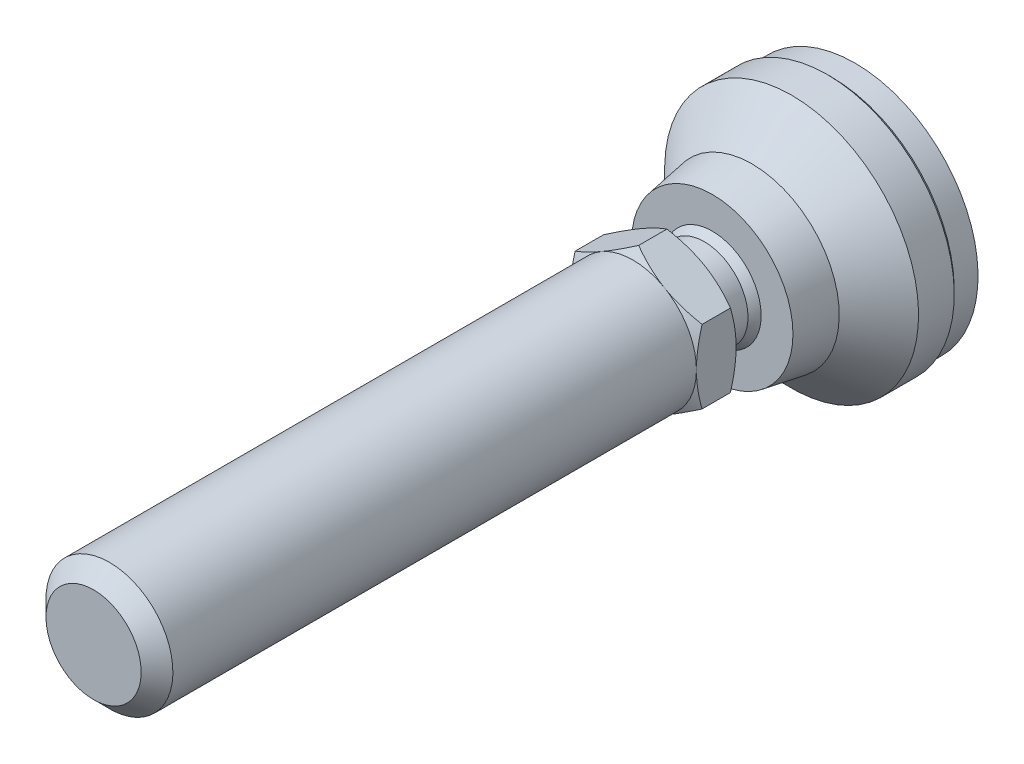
ISO-10303-21;
HEADER;
FILE_DESCRIPTION(('STEP AP214'),'2;1');
FILE_NAME('part.step','',(''),(''),'','','');
FILE_SCHEMA(('AUTOMOTIVE_DESIGN { 1 0 10303 214 1 1 1 1 }'));
ENDSEC;
DATA;
#1=APPLICATION_CONTEXT('core data for automotive mechanical design processes');
#2=APPLICATION_PROTOCOL_DEFINITION('international standard','automotive_design',2000,#1);
#3=PRODUCT_CONTEXT('',#1,'mechanical');
#4=PRODUCT('Part','Part','',(#3));
#5=PRODUCT_RELATED_PRODUCT_CATEGORY('part','',(#4));
#6=PRODUCT_DEFINITION_FORMATION('','',#4);
#7=PRODUCT_DEFINITION_CONTEXT('part definition',#1,'design');
#8=PRODUCT_DEFINITION('design','',#6,#7);
#9=PRODUCT_DEFINITION_SHAPE('','',#8);
#10=(LENGTH_UNIT() NAMED_UNIT(*) SI_UNIT(.MILLI.,.METRE.));
#11=(NAMED_UNIT(*) PLANE_ANGLE_UNIT() SI_UNIT($,.RADIAN.));
#12=(NAMED_UNIT(*) SI_UNIT($,.STERADIAN.) SOLID_ANGLE_UNIT());
#13=UNCERTAINTY_MEASURE_WITH_UNIT(LENGTH_MEASURE(1.E-05),#10,'distance_accuracy_value','');
#14=(GEOMETRIC_REPRESENTATION_CONTEXT(3) GLOBAL_UNCERTAINTY_ASSIGNED_CONTEXT((#13)) GLOBAL_UNIT_ASSIGNED_CONTEXT((#10,
#11,#12)) REPRESENTATION_CONTEXT('',''));
#15=CARTESIAN_POINT('',(0.,0.,0.));
#16=DIRECTION('',(0.,0.,1.));
#17=DIRECTION('',(1.,0.,0.));
#18=AXIS2_PLACEMENT_3D('',#15,#16,#17);
#19=CARTESIAN_POINT('',(-7.7647058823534,0.,23.));
#20=DIRECTION('',(0.,0.,1.));
#21=DIRECTION('',(0.,-1.,0.));
#22=AXIS2_PLACEMENT_3D('',#19,#20,#21);
#23=PLANE('',#22);
#24=CARTESIAN_POINT('',(0.,0.,23.));
#25=DIRECTION('',(0.,0.,-1.));
#26=DIRECTION('',(0.,1.,0.));
#27=AXIS2_PLACEMENT_3D('',#24,#25,#26);
#28=CIRCLE('',#27,5.50000000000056);
#29=CARTESIAN_POINT('',(0.,5.50000000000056,23.));
#30=VERTEX_POINT('',#29);
#31=EDGE_CURVE('E278',#30,#30,#28,.T.);
#32=ORIENTED_EDGE('',*,*,#31,.F.);
#33=EDGE_LOOP('',(#32));
#34=FACE_BOUND('',#33,.T.);
#35=CARTESIAN_POINT('',(0.,0.,23.));
#36=DIRECTION('',(0.,0.,1.));
#37=DIRECTION('',(0.,-1.,0.));
#38=AXIS2_PLACEMENT_3D('',#35,#36,#37);
#39=CIRCLE('',#38,8.);
#40=CARTESIAN_POINT('',(4.,-6.92820323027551,23.));
#41=VERTEX_POINT('',#40);
#42=CARTESIAN_POINT('',(-4.,-6.92820323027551,23.));
#43=VERTEX_POINT('',#42);
#44=EDGE_CURVE('E17',#41,#43,#39,.F.);
#45=ORIENTED_EDGE('',*,*,#44,.T.);
#46=CARTESIAN_POINT('',(-8.,0.,23.));
#47=VERTEX_POINT('',#46);
#48=EDGE_CURVE('E9',#43,#47,#39,.F.);
#49=ORIENTED_EDGE('',*,*,#48,.T.);
#50=CARTESIAN_POINT('',(-4.,6.92820323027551,23.));
#51=VERTEX_POINT('',#50);
#52=EDGE_CURVE('E22',#47,#51,#39,.F.);
#53=ORIENTED_EDGE('',*,*,#52,.T.);
#54=CARTESIAN_POINT('',(4.,6.92820323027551,23.));
#55=VERTEX_POINT('',#54);
#56=EDGE_CURVE('E417',#51,#55,#39,.F.);
#57=ORIENTED_EDGE('',*,*,#56,.T.);
#58=CARTESIAN_POINT('',(8.,0.,23.));
#59=VERTEX_POINT('',#58);
#60=EDGE_CURVE('E120',#55,#59,#39,.F.);
#61=ORIENTED_EDGE('',*,*,#60,.T.);
#62=CARTESIAN_POINT('',(0.,0.,23.));
#63=DIRECTION('',(0.,0.,1.));
#64=DIRECTION('',(0.,-1.,0.));
#65=AXIS2_PLACEMENT_3D('',#62,#63,#64);
#66=CIRCLE('',#65,8.);
#67=EDGE_CURVE('E104',#41,#59,#66,.T.);
#68=ORIENTED_EDGE('',*,*,#67,.F.);
#69=EDGE_LOOP('',(#45,#49,#53,#57,#61,#68));
#70=FACE_BOUND('',#69,.T.);
#71=ADVANCED_FACE('F14',(#34,#70),#23,.F.);
#72=CARTESIAN_POINT('',(0.,0.,3.));
#73=DIRECTION('',(0.,0.,-1.));
#74=DIRECTION('',(0.,1.,0.));
#75=AXIS2_PLACEMENT_3D('',#72,#73,#74);
#76=CYLINDRICAL_SURFACE('',#75,5.50000000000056);
#77=CARTESIAN_POINT('',(0.,0.,18.9999999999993));
#78=DIRECTION('',(0.,0.,-1.));
#79=DIRECTION('',(0.,1.,0.));
#80=AXIS2_PLACEMENT_3D('',#77,#78,#79);
#81=CIRCLE('',#80,5.50000000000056);
#82=CARTESIAN_POINT('',(0.,-5.50000000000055,18.9999999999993));
#83=VERTEX_POINT('',#82);
#84=EDGE_CURVE('E242',#83,#83,#81,.T.);
#85=ORIENTED_EDGE('',*,*,#84,.F.);
#86=EDGE_LOOP('',(#85));
#87=FACE_BOUND('',#86,.T.);
#88=ORIENTED_EDGE('',*,*,#31,.T.);
#89=EDGE_LOOP('',(#88));
#90=FACE_BOUND('',#89,.T.);
#91=ADVANCED_FACE('F346',(#87,#90),#76,.T.);
#92=CARTESIAN_POINT('',(0.,0.,14.6698729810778));
#93=DIRECTION('',(0.,0.,-1.));
#94=DIRECTION('',(0.,-1.,0.));
#95=AXIS2_PLACEMENT_3D('',#92,#93,#94);
#96=SPHERICAL_SURFACE('',#95,7.);
#97=CARTESIAN_POINT('',(0.,0.,18.));
#98=DIRECTION('',(0.,0.,-1.));
#99=DIRECTION('',(0.,1.,0.));
#100=AXIS2_PLACEMENT_3D('',#97,#98,#99);
#101=CIRCLE('',#100,6.15713034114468);
#102=CARTESIAN_POINT('',(0.,-6.15713034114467,18.));
#103=VERTEX_POINT('',#102);
#104=EDGE_CURVE('E246',#103,#103,#101,.T.);
#105=CARTESIAN_POINT('',(0.,-5.50000000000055,18.9999999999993));
#106=CARTESIAN_POINT('',(0.,-5.50771979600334,18.9901945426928));
#107=CARTESIAN_POINT('',(0.,-5.51541336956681,18.9803684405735));
#108=CARTESIAN_POINT('',(0.,-5.53074785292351,18.9606752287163));
#109=CARTESIAN_POINT('',(0.,-5.53838876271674,18.9508081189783));
#110=CARTESIAN_POINT('',(0.,-5.55361769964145,18.9310331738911));
#111=CARTESIAN_POINT('',(0.,-5.56120572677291,18.9211253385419));
#112=CARTESIAN_POINT('',(0.,-5.57632868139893,18.9012692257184));
#113=CARTESIAN_POINT('',(0.,-5.58386360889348,18.8913209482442));
#114=CARTESIAN_POINT('',(0.,-5.59888014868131,18.8713842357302));
#115=CARTESIAN_POINT('',(0.,-5.60636176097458,18.8613958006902));
#116=CARTESIAN_POINT('',(0.,-5.62127145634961,18.8413790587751));
#117=CARTESIAN_POINT('',(0.,-5.62869953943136,18.8313507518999));
#118=CARTESIAN_POINT('',(0.,-5.64350196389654,18.8112545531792));
#119=CARTESIAN_POINT('',(0.,-5.65087630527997,18.8011866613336));
#120=CARTESIAN_POINT('',(0.,-5.66557103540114,18.7810115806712));
#121=CARTESIAN_POINT('',(0.,-5.67289142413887,18.7709043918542));
#122=CARTESIAN_POINT('',(0.,-5.68747803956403,18.7506510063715));
#123=CARTESIAN_POINT('',(0.,-5.69474426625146,18.7405048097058));
#124=CARTESIAN_POINT('',(0.,-5.70922234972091,18.7201736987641));
#125=CARTESIAN_POINT('',(0.,-5.71643420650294,18.7099887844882));
#126=CARTESIAN_POINT('',(0.,-5.73080334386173,18.6895805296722));
#127=CARTESIAN_POINT('',(0.,-5.73796062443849,18.6793571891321));
#128=CARTESIAN_POINT('',(0.,-5.75222040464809,18.6588723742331));
#129=CARTESIAN_POINT('',(0.,-5.75932290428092,18.6486108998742));
#130=CARTESIAN_POINT('',(0.,-5.77347291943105,18.6280501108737));
#131=CARTESIAN_POINT('',(0.,-5.78052043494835,18.6177507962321));
#132=CARTESIAN_POINT('',(0.,-5.79456028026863,18.5971146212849));
#133=CARTESIAN_POINT('',(0.,-5.80155261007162,18.5867777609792));
#134=CARTESIAN_POINT('',(0.,-5.81548188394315,18.5660667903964));
#135=CARTESIAN_POINT('',(0.,-5.82241882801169,18.5556926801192));
#136=CARTESIAN_POINT('',(0.,-5.83623713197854,18.5349075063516));
#137=CARTESIAN_POINT('',(0.,-5.84311849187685,18.5244964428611));
#138=CARTESIAN_POINT('',(0.,-5.85682543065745,18.503637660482));
#139=CARTESIAN_POINT('',(0.,-5.86365100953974,18.4931899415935));
#140=CARTESIAN_POINT('',(0.,-5.8772461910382,18.4722581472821));
#141=CARTESIAN_POINT('',(0.,-5.88401579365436,18.4617740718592));
#142=CARTESIAN_POINT('',(0.,-5.89749882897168,18.440769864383));
#143=CARTESIAN_POINT('',(0.,-5.90421226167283,18.4302497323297));
#144=CARTESIAN_POINT('',(0.,-5.91758276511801,18.4091737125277));
#145=CARTESIAN_POINT('',(0.,-5.92423983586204,18.398617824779));
#146=CARTESIAN_POINT('',(0.,-5.93749742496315,18.3774705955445));
#147=CARTESIAN_POINT('',(0.,-5.94409794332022,18.3668792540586));
#148=CARTESIAN_POINT('',(0.,-5.9572422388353,18.3456614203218));
#149=CARTESIAN_POINT('',(0.,-5.96378601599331,18.3350349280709));
#150=CARTESIAN_POINT('',(0.,-5.97681664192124,18.3137470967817));
#151=CARTESIAN_POINT('',(0.,-5.98330349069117,18.3030857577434));
#152=CARTESIAN_POINT('',(0.,-5.99622007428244,18.2817285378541));
#153=CARTESIAN_POINT('',(0.,-6.00264980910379,18.271032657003));
#154=CARTESIAN_POINT('',(0.,-6.0154519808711,18.2496066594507));
#155=CARTESIAN_POINT('',(0.,-6.02182441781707,18.2388765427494));
#156=CARTESIAN_POINT('',(0.,-6.03451181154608,18.2173823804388));
#157=CARTESIAN_POINT('',(0.,-6.04082676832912,18.2066183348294));
#158=CARTESIAN_POINT('',(0.,-6.05339902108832,18.1850566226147));
#159=CARTESIAN_POINT('',(0.,-6.05965631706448,18.1742589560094));
#160=CARTESIAN_POINT('',(0.,-6.07211306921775,18.1526303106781));
#161=CARTESIAN_POINT('',(0.,-6.07831252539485,18.1417993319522));
#162=CARTESIAN_POINT('',(0.,-6.09065342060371,18.1201043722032));
#163=CARTESIAN_POINT('',(0.,-6.09679485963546,18.1092403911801));
#164=CARTESIAN_POINT('',(0.,-6.10901954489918,18.0874797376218));
#165=CARTESIAN_POINT('',(0.,-6.11510279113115,18.0765830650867));
#166=CARTESIAN_POINT('',(0.,-6.12721091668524,18.0547573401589));
#167=CARTESIAN_POINT('',(0.,-6.13323579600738,18.0438282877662));
#168=CARTESIAN_POINT('',(0.,-6.14522701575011,18.0219381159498));
#169=CARTESIAN_POINT('',(0.,-6.15119335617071,18.010976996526));
#170=CARTESIAN_POINT('',(0.,-6.15713034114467,18.));
#171=B_SPLINE_CURVE_WITH_KNOTS('',3,(#105,#106,#107,#108,#109,#110,#111,#112,#113,#114,#115,
#116,#117,#118,#119,#120,#121,#122,#123,#124,#125,#126,#127,#128,#129,#130,#131,#132,#133,#134,
#135,#136,#137,#138,#139,#140,#141,#142,#143,#144,#145,#146,#147,#148,#149,#150,#151,#152,#153,
#154,#155,#156,#157,#158,#159,#160,#161,#162,#163,#164,#165,#166,#167,#168,#169,#170),
.UNSPECIFIED.,.F.,.F.,(4,2,2,2,2,2,2,2,2,2,2,2,2,2,2,2,2,2,2,2,2,2,2,2,2,2,2,2,2,2,2,2,4),(0.,
0.0374389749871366,0.0748779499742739,0.112316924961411,0.149755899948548,0.187194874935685,
0.224633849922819,0.262072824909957,0.299511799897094,0.336950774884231,0.374389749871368,
0.411828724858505,0.449267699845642,0.486706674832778,0.524145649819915,0.56158462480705,
0.599023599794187,0.636462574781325,0.67390154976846,0.711340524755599,0.748779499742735,
0.786218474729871,0.823657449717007,0.861096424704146,0.898535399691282,0.93597437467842,
0.973413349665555,1.01085232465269,1.04829129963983,1.08573027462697,1.1231692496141,
1.16060822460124,1.19804719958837),.UNSPECIFIED.);
#172=EDGE_CURVE('BSEAM342',#83,#103,#171,.T.);
#173=ORIENTED_EDGE('',*,*,#84,.T.);
#174=ORIENTED_EDGE('',*,*,#104,.F.);
#175=ORIENTED_EDGE('',*,*,#172,.T.);
#176=ORIENTED_EDGE('',*,*,#172,.F.);
#177=EDGE_LOOP('',(#173,#175,#174,#176));
#178=FACE_BOUND('',#177,.T.);
#179=ADVANCED_FACE('F342',(#178),#96,.T.);
#180=CARTESIAN_POINT('',(0.,0.,3.50000000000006));
#181=DIRECTION('',(0.,0.,1.));
#182=DIRECTION('',(0.,-1.,0.));
#183=AXIS2_PLACEMENT_3D('',#180,#181,#182);
#184=CONICAL_SURFACE('',#183,16.,0.785398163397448);
#185=CARTESIAN_POINT('',(0.,0.,3.));
#186=DIRECTION('',(0.,0.,-1.));
#187=DIRECTION('',(0.,1.,0.));
#188=AXIS2_PLACEMENT_3D('',#185,#186,#187);
#189=CIRCLE('',#188,15.5);
#190=CARTESIAN_POINT('',(0.,15.5,3.));
#191=VERTEX_POINT('',#190);
#192=EDGE_CURVE('E267',#191,#191,#189,.T.);
#193=ORIENTED_EDGE('',*,*,#192,.F.);
#194=EDGE_LOOP('',(#193));
#195=FACE_BOUND('',#194,.T.);
#196=CARTESIAN_POINT('',(0.,0.,3.50000000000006));
#197=DIRECTION('',(0.,0.,-1.));
#198=DIRECTION('',(0.,1.,0.));
#199=AXIS2_PLACEMENT_3D('',#196,#197,#198);
#200=CIRCLE('',#199,16.);
#201=CARTESIAN_POINT('',(0.,16.,3.50000000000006));
#202=VERTEX_POINT('',#201);
#203=EDGE_CURVE('E270',#202,#202,#200,.T.);
#204=ORIENTED_EDGE('',*,*,#203,.T.);
#205=EDGE_LOOP('',(#204));
#206=FACE_BOUND('',#205,.T.);
#207=ADVANCED_FACE('F345',(#195,#206),#184,.T.);
#208=CARTESIAN_POINT('',(0.,0.,3.));
#209=DIRECTION('',(0.,0.,-1.));
#210=DIRECTION('',(0.,1.,0.));
#211=AXIS2_PLACEMENT_3D('',#208,#209,#210);
#212=CYLINDRICAL_SURFACE('',#211,16.);
#213=ORIENTED_EDGE('',*,*,#203,.F.);
#214=EDGE_LOOP('',(#213));
#215=FACE_BOUND('',#214,.T.);
#216=CARTESIAN_POINT('',(0.,0.,8.));
#217=DIRECTION('',(0.,0.,-1.));
#218=DIRECTION('',(0.,1.,0.));
#219=AXIS2_PLACEMENT_3D('',#216,#217,#218);
#220=CIRCLE('',#219,16.);
#221=CARTESIAN_POINT('',(0.,16.,8.));
#222=VERTEX_POINT('',#221);
#223=EDGE_CURVE('E273',#222,#222,#220,.T.);
#224=ORIENTED_EDGE('',*,*,#223,.T.);
#225=EDGE_LOOP('',(#224));
#226=FACE_BOUND('',#225,.T.);
#227=ADVANCED_FACE('F385',(#215,#226),#212,.T.);
#228=CARTESIAN_POINT('',(0.,0.,13.));
#229=DIRECTION('',(0.,0.,-1.));
#230=DIRECTION('',(0.,1.,0.));
#231=AXIS2_PLACEMENT_3D('',#228,#229,#230);
#232=CONICAL_SURFACE('',#231,11.,0.785398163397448);
#233=ORIENTED_EDGE('',*,*,#223,.F.);
#234=EDGE_LOOP('',(#233));
#235=FACE_BOUND('',#234,.T.);
#236=CARTESIAN_POINT('',(0.,0.,13.));
#237=DIRECTION('',(0.,0.,-1.));
#238=DIRECTION('',(0.,1.,0.));
#239=AXIS2_PLACEMENT_3D('',#236,#237,#238);
#240=CIRCLE('',#239,11.);
#241=CARTESIAN_POINT('',(0.,11.,13.));
#242=VERTEX_POINT('',#241);
#243=EDGE_CURVE('E276',#242,#242,#240,.T.);
#244=ORIENTED_EDGE('',*,*,#243,.T.);
#245=EDGE_LOOP('',(#244));
#246=FACE_BOUND('',#245,.T.);
#247=ADVANCED_FACE('F381',(#235,#246),#232,.T.);
#248=CARTESIAN_POINT('',(0.,0.,19.));
#249=DIRECTION('',(0.,0.,-1.));
#250=DIRECTION('',(0.,1.,0.));
#251=AXIS2_PLACEMENT_3D('',#248,#249,#250);
#252=CONICAL_SURFACE('',#251,10.,0.165148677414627);
#253=CARTESIAN_POINT('',(0.,0.,18.));
#254=DIRECTION('',(0.,0.,1.));
#255=DIRECTION('',(0.,-1.,0.));
#256=AXIS2_PLACEMENT_3D('',#253,#254,#255);
#257=CIRCLE('',#256,10.1666666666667);
#258=CARTESIAN_POINT('',(0.,-10.1666666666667,18.));
#259=VERTEX_POINT('',#258);
#260=EDGE_CURVE('E249',#259,#259,#257,.T.);
#261=ORIENTED_EDGE('',*,*,#260,.F.);
#262=EDGE_LOOP('',(#261));
#263=FACE_BOUND('',#262,.T.);
#264=ORIENTED_EDGE('',*,*,#243,.F.);
#265=EDGE_LOOP('',(#264));
#266=FACE_BOUND('',#265,.T.);
#267=ADVANCED_FACE('F340',(#263,#266),#252,.T.);
#268=CARTESIAN_POINT('',(-6.60079601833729,0.,18.));
#269=DIRECTION('',(0.,0.,-1.));
#270=DIRECTION('',(0.,1.,0.));
#271=AXIS2_PLACEMENT_3D('',#268,#269,#270);
#272=PLANE('',#271);
#273=ORIENTED_EDGE('',*,*,#260,.T.);
#274=EDGE_LOOP('',(#273));
#275=FACE_BOUND('',#274,.T.);
#276=ORIENTED_EDGE('',*,*,#104,.T.);
#277=EDGE_LOOP('',(#276));
#278=FACE_BOUND('',#277,.T.);
#279=ADVANCED_FACE('F335',(#275,#278),#272,.F.);
#280=CARTESIAN_POINT('',(0.,0.,0.));
#281=DIRECTION('',(0.,0.,1.));
#282=DIRECTION('',(0.,-1.,0.));
#283=AXIS2_PLACEMENT_3D('',#280,#281,#282);
#284=CYLINDRICAL_SURFACE('',#283,15.5);
#285=CARTESIAN_POINT('',(0.,0.,0.));
#286=DIRECTION('',(0.,0.,-1.));
#287=DIRECTION('',(0.,1.,0.));
#288=AXIS2_PLACEMENT_3D('',#285,#286,#287);
#289=CIRCLE('',#288,15.5);
#290=CARTESIAN_POINT('',(0.,15.5,0.));
#291=VERTEX_POINT('',#290);
#292=EDGE_CURVE('E230',#291,#291,#289,.T.);
#293=ORIENTED_EDGE('',*,*,#292,.F.);
#294=EDGE_LOOP('',(#293));
#295=FACE_BOUND('',#294,.T.);
#296=ORIENTED_EDGE('',*,*,#192,.T.);
#297=EDGE_LOOP('',(#296));
#298=FACE_BOUND('',#297,.T.);
#299=ADVANCED_FACE('F339',(#295,#298),#284,.T.);
#300=CARTESIAN_POINT('',(0.,0.,0.));
#301=DIRECTION('',(0.,0.,-1.));
#302=DIRECTION('',(0.,1.,0.));
#303=AXIS2_PLACEMENT_3D('',#300,#301,#302);
#304=PLANE('',#303);
#305=ORIENTED_EDGE('',*,*,#292,.T.);
#306=EDGE_LOOP('',(#305));
#307=FACE_BOUND('',#306,.T.);
#308=ADVANCED_FACE('F358',(#307),#304,.T.);
#309=CARTESIAN_POINT('',(0.,0.,23.));
#310=DIRECTION('',(0.,0.,1.));
#311=DIRECTION('',(0.,-1.,0.));
#312=AXIS2_PLACEMENT_3D('',#309,#310,#311);
#313=CONICAL_SURFACE('',#312,8.,1.0471975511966);
#314=ORIENTED_EDGE('',*,*,#44,.F.);
#315=CARTESIAN_POINT('',(-0.00019999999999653,-9.23771977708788,23.714597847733));
#316=CARTESIAN_POINT('',(0.175648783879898,-9.13619343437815,23.6559907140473));
#317=CARTESIAN_POINT('',(0.352153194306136,-9.03428856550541,23.6000434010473));
#318=CARTESIAN_POINT('',(0.706595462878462,-8.829651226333,23.4942010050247));
#319=CARTESIAN_POINT('',(0.884533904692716,-8.72691841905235,23.4443085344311));
#320=CARTESIAN_POINT('',(1.42119823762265,-8.41707512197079,23.3046927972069));
#321=CARTESIAN_POINT('',(1.78204258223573,-8.20874154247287,23.2252811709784));
#322=CARTESIAN_POINT('',(2.32203917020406,-7.89697436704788,23.1321616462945));
#323=CARTESIAN_POINT('',(2.49957818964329,-7.79447216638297,23.1056345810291));
#324=CARTESIAN_POINT('',(2.85545911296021,-7.5890042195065,23.0611531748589));
#325=CARTESIAN_POINT('',(3.03380094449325,-7.48603851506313,23.0431980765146));
#326=CARTESIAN_POINT('',(3.3907916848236,-7.27992981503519,23.0163156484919));
#327=CARTESIAN_POINT('',(3.56944001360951,-7.17678715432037,23.0073780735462));
#328=CARTESIAN_POINT('',(3.92690170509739,-6.97040655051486,22.9987223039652));
#329=CARTESIAN_POINT('',(4.10571506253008,-6.8671686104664,22.9990038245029));
#330=CARTESIAN_POINT('',(4.44001336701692,-6.67416139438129,23.0081450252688));
#331=CARTESIAN_POINT('',(4.59552190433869,-6.58437849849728,23.0158896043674));
#332=CARTESIAN_POINT('',(4.90617476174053,-6.4050229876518,23.0382011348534));
#333=CARTESIAN_POINT('',(5.06131905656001,-6.31545038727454,23.0527685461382));
#334=CARTESIAN_POINT('',(5.52615131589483,-6.04707935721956,23.1063606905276));
#335=CARTESIAN_POINT('',(5.83501648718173,-5.86875596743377,23.1552686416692));
#336=CARTESIAN_POINT('',(6.45602322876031,-5.5102175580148,23.2775394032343));
#337=CARTESIAN_POINT('',(6.76808554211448,-5.33004829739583,23.351420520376));
#338=CARTESIAN_POINT('',(7.38755648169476,-4.97239658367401,23.519100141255));
#339=CARTESIAN_POINT('',(7.69497304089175,-4.79490955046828,23.6128592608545));
#340=CARTESIAN_POINT('',(8.0002,-4.6186866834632,23.714597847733));
#341=B_SPLINE_CURVE_WITH_KNOTS('',3,(#315,#316,#317,#318,#319,#320,#321,#322,#323,#324,#325,
#326,#327,#328,#329,#330,#331,#332,#333,#334,#335,#336,#337,#338,#339,#340),.UNSPECIFIED.,.F.,
.F.,(4,2,2,2,2,2,2,2,2,2,2,2,4),(0.,0.633973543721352,1.26821965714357,2.53934712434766,
3.1593434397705,3.77928496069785,4.39852133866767,5.01773858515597,5.5568023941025,
6.09590254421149,7.17487077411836,8.27776850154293,9.37850115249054),.UNSPECIFIED.);
#342=CARTESIAN_POINT('',(0.,-9.23760430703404,23.7145311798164));
#343=VERTEX_POINT('',#342);
#344=EDGE_CURVE('E112',#343,#41,#341,.T.);
#345=ORIENTED_EDGE('',*,*,#344,.F.);
#346=CARTESIAN_POINT('',(-8.0002,-4.6186866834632,23.714597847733));
#347=CARTESIAN_POINT('',(-7.82435121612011,-4.72021302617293,23.6559907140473));
#348=CARTESIAN_POINT('',(-7.64784680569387,-4.82211789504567,23.6000434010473));
#349=CARTESIAN_POINT('',(-7.29340453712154,-5.02675523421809,23.4942010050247));
#350=CARTESIAN_POINT('',(-7.11546609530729,-5.12948804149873,23.4443085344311));
#351=CARTESIAN_POINT('',(-6.57880176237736,-5.43933133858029,23.3046927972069));
#352=CARTESIAN_POINT('',(-6.21795741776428,-5.64766491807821,23.2252811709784));
#353=CARTESIAN_POINT('',(-5.67796082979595,-5.9594320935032,23.1321616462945));
#354=CARTESIAN_POINT('',(-5.50042181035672,-6.06193429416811,23.1056345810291));
#355=CARTESIAN_POINT('',(-5.1445408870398,-6.26740224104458,23.0611531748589));
#356=CARTESIAN_POINT('',(-4.96619905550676,-6.37036794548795,23.0431980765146));
#357=CARTESIAN_POINT('',(-4.6092083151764,-6.57647664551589,23.0163156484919));
#358=CARTESIAN_POINT('',(-4.43055998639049,-6.67961930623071,23.0073780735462));
#359=CARTESIAN_POINT('',(-4.07309829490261,-6.88599991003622,22.9987223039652));
#360=CARTESIAN_POINT('',(-3.89428493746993,-6.98923785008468,22.9990038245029));
#361=CARTESIAN_POINT('',(-3.55998663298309,-7.18224506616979,23.0081450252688));
#362=CARTESIAN_POINT('',(-3.40447809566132,-7.2720279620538,23.0158896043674));
#363=CARTESIAN_POINT('',(-3.09382523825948,-7.45138347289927,23.0382011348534));
#364=CARTESIAN_POINT('',(-2.93868094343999,-7.54095607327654,23.0527685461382));
#365=CARTESIAN_POINT('',(-2.47384868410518,-7.80932710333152,23.1063606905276));
#366=CARTESIAN_POINT('',(-2.16498351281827,-7.98765049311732,23.1552686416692));
#367=CARTESIAN_POINT('',(-1.54397677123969,-8.34618890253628,23.2775394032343));
#368=CARTESIAN_POINT('',(-1.23191445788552,-8.52635816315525,23.351420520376));
#369=CARTESIAN_POINT('',(-0.612443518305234,-8.88400987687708,23.519100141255));
#370=CARTESIAN_POINT('',(-0.305026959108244,-9.06149691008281,23.6128592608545));
#371=CARTESIAN_POINT('',(0.000200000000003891,-9.23771977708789,23.714597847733));
#372=B_SPLINE_CURVE_WITH_KNOTS('',3,(#346,#347,#348,#349,#350,#351,#352,#353,#354,#355,#356,
#357,#358,#359,#360,#361,#362,#363,#364,#365,#366,#367,#368,#369,#370,#371),.UNSPECIFIED.,.F.,
.F.,(4,2,2,2,2,2,2,2,2,2,2,2,4),(0.,0.633973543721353,1.26821965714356,2.53934712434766,
3.15934343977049,3.77928496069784,4.39852133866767,5.01773858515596,5.5568023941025,
6.09590254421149,7.17487077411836,8.27776850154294,9.37850115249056),.UNSPECIFIED.);
#373=EDGE_CURVE('E118',#43,#343,#372,.T.);
#374=ORIENTED_EDGE('',*,*,#373,.F.);
#375=EDGE_LOOP('',(#314,#345,#374));
#376=FACE_BOUND('',#375,.T.);
#377=ADVANCED_FACE('F116',(#376),#313,.T.);
#378=ORIENTED_EDGE('',*,*,#67,.T.);
#379=CARTESIAN_POINT('',(8.,12.3528393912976,26.8781118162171));
#380=CARTESIAN_POINT('',(8.,12.0038798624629,26.7090523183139));
#381=CARTESIAN_POINT('',(7.99999999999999,11.6541134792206,26.5416294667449));
#382=CARTESIAN_POINT('',(7.99999999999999,10.9525377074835,26.2109786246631));
#383=CARTESIAN_POINT('',(7.99999999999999,10.6007280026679,26.0477513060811));
#384=CARTESIAN_POINT('',(7.99999999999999,9.89279763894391,25.7255803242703));
#385=CARTESIAN_POINT('',(7.99999999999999,9.53666390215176,25.5666652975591));
#386=CARTESIAN_POINT('',(7.99999999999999,8.82154506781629,25.2554107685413));
#387=CARTESIAN_POINT('',(7.99999999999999,8.46256010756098,25.10307095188));
#388=CARTESIAN_POINT('',(7.99999999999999,7.72977879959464,24.802025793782));
#389=CARTESIAN_POINT('',(7.99999999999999,7.35587245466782,24.6535867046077));
#390=CARTESIAN_POINT('',(7.99999999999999,6.60366634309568,24.3680738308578));
#391=CARTESIAN_POINT('',(8.,6.22536608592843,24.2310013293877));
#392=CARTESIAN_POINT('',(8.,5.46449142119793,23.9718600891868));
#393=CARTESIAN_POINT('',(7.99999999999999,5.08192763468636,23.8497605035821));
#394=CARTESIAN_POINT('',(8.,4.31132670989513,23.6245168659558));
#395=CARTESIAN_POINT('',(8.,3.92329135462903,23.5213667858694));
#396=CARTESIAN_POINT('',(8.,3.14361138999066,23.3395619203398));
#397=CARTESIAN_POINT('',(8.,2.75199821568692,23.2607759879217));
#398=CARTESIAN_POINT('',(8.,2.16105570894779,23.1643065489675));
#399=CARTESIAN_POINT('',(8.,1.96347278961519,23.1357669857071));
#400=CARTESIAN_POINT('',(8.,1.56734328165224,23.0864853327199));
#401=CARTESIAN_POINT('',(8.,1.36879678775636,23.065742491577));
#402=CARTESIAN_POINT('',(8.,0.973575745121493,23.0327248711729));
#403=CARTESIAN_POINT('',(8.,0.776910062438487,23.0203443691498));
#404=CARTESIAN_POINT('',(8.,0.383231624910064,23.0039073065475));
#405=CARTESIAN_POINT('',(8.,0.186218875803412,22.9998506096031));
#406=CARTESIAN_POINT('',(8.,-0.207801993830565,23.0001577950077));
#407=CARTESIAN_POINT('',(8.,-0.404810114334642,23.0045217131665));
#408=CARTESIAN_POINT('',(8.,-0.798468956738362,23.0215643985));
#409=CARTESIAN_POINT('',(8.,-0.995119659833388,23.0342435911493));
#410=CARTESIAN_POINT('',(8.,-1.46938740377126,23.074583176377));
#411=CARTESIAN_POINT('',(8.,-1.74666812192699,23.1062808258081));
#412=CARTESIAN_POINT('',(8.,-2.29912288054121,23.1844659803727));
#413=CARTESIAN_POINT('',(8.,-2.57429662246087,23.230955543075));
#414=CARTESIAN_POINT('',(8.,-3.39637100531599,23.3901427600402));
#415=CARTESIAN_POINT('',(8.,-3.939506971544,23.5225283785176));
#416=CARTESIAN_POINT('',(8.,-4.751545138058,23.7514776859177));
#417=CARTESIAN_POINT('',(8.,-5.02467523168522,23.8339031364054));
#418=CARTESIAN_POINT('',(8.,-5.56828168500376,24.0071617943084));
#419=CARTESIAN_POINT('',(8.,-5.83875802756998,24.0979950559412));
#420=CARTESIAN_POINT('',(8.,-6.37714479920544,24.2866247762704));
#421=CARTESIAN_POINT('',(8.,-6.64505607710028,24.3844188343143));
#422=CARTESIAN_POINT('',(8.,-7.17866955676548,24.5858348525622));
#423=CARTESIAN_POINT('',(8.,-7.44437178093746,24.6894567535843));
#424=CARTESIAN_POINT('',(8.,-8.05672854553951,24.9347753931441));
#425=CARTESIAN_POINT('',(8.,-8.40267610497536,25.0782332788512));
#426=CARTESIAN_POINT('',(8.,-9.0917434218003,25.3718054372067));
#427=CARTESIAN_POINT('',(8.,-9.43486302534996,25.5219200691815));
#428=CARTESIAN_POINT('',(8.,-10.1187748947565,25.8275104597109));
#429=CARTESIAN_POINT('',(8.,-10.4595667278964,25.9829871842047));
#430=CARTESIAN_POINT('',(8.,-11.1391487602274,26.2982627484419));
#431=CARTESIAN_POINT('',(8.,-11.4779389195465,26.4580616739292));
#432=CARTESIAN_POINT('',(8.,-12.1541625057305,26.7813505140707));
#433=CARTESIAN_POINT('',(8.,-12.4915942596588,26.9448439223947));
#434=CARTESIAN_POINT('',(8.,-13.1650251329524,27.2747577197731));
#435=CARTESIAN_POINT('',(8.,-13.5010242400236,27.4411781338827));
#436=CARTESIAN_POINT('',(8.,-14.5071242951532,27.9440323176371));
#437=CARTESIAN_POINT('',(8.,-15.1754096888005,28.2840984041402));
#438=CARTESIAN_POINT('',(8.,-16.4549150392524,28.9435261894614));
#439=CARTESIAN_POINT('',(8.00000000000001,-17.066409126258,29.2623583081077));
#440=CARTESIAN_POINT('',(8.00000000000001,-18.2871010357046,29.9044318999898));
#441=CARTESIAN_POINT('',(8.00000000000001,-18.8962987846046,30.2276735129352));
#442=CARTESIAN_POINT('',(8.00000000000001,-20.1114738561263,30.8767730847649));
#443=CARTESIAN_POINT('',(8.00000000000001,-20.717455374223,31.2026232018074));
#444=CARTESIAN_POINT('',(8.00000000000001,-21.9279409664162,31.8569829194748));
#445=CARTESIAN_POINT('',(8.00000000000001,-22.5324451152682,32.1854923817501));
#446=CARTESIAN_POINT('',(8.,-23.1364011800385,32.51499964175));
#447=B_SPLINE_CURVE_WITH_KNOTS('',3,(#379,#380,#381,#382,#383,#384,#385,#386,#387,#388,#389,
#390,#391,#392,#393,#394,#395,#396,#397,#398,#399,#400,#401,#402,#403,#404,#405,#406,#407,#408,
#409,#410,#411,#412,#413,#414,#415,#416,#417,#418,#419,#420,#421,#422,#423,#424,#425,#426,#427,
#428,#429,#430,#431,#432,#433,#434,#435,#436,#437,#438,#439,#440,#441,#442,#443,#444,#445,#446),
.UNSPECIFIED.,.F.,.F.,(4,2,2,2,2,2,2,2,2,2,2,2,2,2,2,2,2,2,2,2,2,2,2,2,2,2,2,2,2,2,2,2,2,4),(0.,
1.16327918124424,2.32674351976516,3.49663345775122,4.66646740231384,5.87320476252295,
7.08007815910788,8.28442185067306,9.48838176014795,10.6857434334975,11.284514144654,
11.8832271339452,12.4742215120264,13.0652062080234,13.6561934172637,14.2472108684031,
15.0839966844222,15.9208989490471,17.5956570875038,18.4514767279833,19.307301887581,
20.1628333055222,21.0183560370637,22.141802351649,23.2653093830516,24.3890198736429,
25.5127526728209,26.6375967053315,27.762450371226,30.0118856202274,32.08073329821,
34.1496466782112,36.2137440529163,38.2777347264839),.UNSPECIFIED.);
#448=CARTESIAN_POINT('',(8.,-4.61880215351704,23.7145311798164));
#449=VERTEX_POINT('',#448);
#450=EDGE_CURVE('E107',#449,#59,#447,.F.);
#451=ORIENTED_EDGE('',*,*,#450,.F.);
#452=EDGE_CURVE('E100',#41,#449,#341,.T.);
#453=ORIENTED_EDGE('',*,*,#452,.F.);
#454=EDGE_LOOP('',(#378,#451,#453));
#455=FACE_BOUND('',#454,.T.);
#456=ADVANCED_FACE('F102',(#455),#313,.T.);
#457=ORIENTED_EDGE('',*,*,#60,.F.);
#458=CARTESIAN_POINT('',(8.0002,4.61868668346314,23.7145978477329));
#459=CARTESIAN_POINT('',(7.8243512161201,4.72021302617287,23.6559907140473));
#460=CARTESIAN_POINT('',(7.64784680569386,4.82211789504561,23.6000434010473));
#461=CARTESIAN_POINT('',(7.29340453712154,5.02675523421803,23.4942010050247));
#462=CARTESIAN_POINT('',(7.11546609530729,5.12948804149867,23.4443085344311));
#463=CARTESIAN_POINT('',(6.57880176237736,5.43933133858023,23.3046927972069));
#464=CARTESIAN_POINT('',(6.21795741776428,5.64766491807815,23.2252811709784));
#465=CARTESIAN_POINT('',(5.67796082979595,5.95943209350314,23.1321616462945));
#466=CARTESIAN_POINT('',(5.50042181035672,6.06193429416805,23.1056345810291));
#467=CARTESIAN_POINT('',(5.1445408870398,6.26740224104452,23.0611531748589));
#468=CARTESIAN_POINT('',(4.96619905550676,6.37036794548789,23.0431980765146));
#469=CARTESIAN_POINT('',(4.60920831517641,6.57647664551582,23.0163156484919));
#470=CARTESIAN_POINT('',(4.4305599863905,6.67961930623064,23.0073780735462));
#471=CARTESIAN_POINT('',(4.07309829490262,6.88599991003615,22.9987223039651));
#472=CARTESIAN_POINT('',(3.89428493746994,6.98923785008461,22.9990038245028));
#473=CARTESIAN_POINT('',(3.5599866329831,7.18224506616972,23.0081450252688));
#474=CARTESIAN_POINT('',(3.40447809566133,7.27202796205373,23.0158896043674));
#475=CARTESIAN_POINT('',(3.09382523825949,7.45138347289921,23.0382011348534));
#476=CARTESIAN_POINT('',(2.93868094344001,7.54095607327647,23.0527685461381));
#477=CARTESIAN_POINT('',(2.47384868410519,7.80932710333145,23.1063606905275));
#478=CARTESIAN_POINT('',(2.16498351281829,7.98765049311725,23.1552686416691));
#479=CARTESIAN_POINT('',(1.54397677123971,8.34618890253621,23.2775394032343));
#480=CARTESIAN_POINT('',(1.23191445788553,8.52635816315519,23.351420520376));
#481=CARTESIAN_POINT('',(0.612443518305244,8.88400987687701,23.519100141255));
#482=CARTESIAN_POINT('',(0.305026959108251,9.06149691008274,23.6128592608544));
#483=CARTESIAN_POINT('',(-0.000199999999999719,9.23771977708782,23.7145978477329));
#484=B_SPLINE_CURVE_WITH_KNOTS('',3,(#458,#459,#460,#461,#462,#463,#464,#465,#466,#467,#468,
#469,#470,#471,#472,#473,#474,#475,#476,#477,#478,#479,#480,#481,#482,#483),.UNSPECIFIED.,.F.,
.F.,(4,2,2,2,2,2,2,2,2,2,2,2,4),(0.,0.633973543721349,1.26821965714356,2.53934712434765,
3.15934343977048,3.77928496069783,4.39852133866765,5.01773858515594,5.55680239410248,
6.09590254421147,7.17487077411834,8.27776850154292,9.37850115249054),.UNSPECIFIED.);
#485=CARTESIAN_POINT('',(8.,4.61880215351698,23.7145311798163));
#486=VERTEX_POINT('',#485);
#487=EDGE_CURVE('E187',#486,#55,#484,.T.);
#488=ORIENTED_EDGE('',*,*,#487,.F.);
#489=EDGE_CURVE('E139',#59,#486,#447,.F.);
#490=ORIENTED_EDGE('',*,*,#489,.F.);
#491=EDGE_LOOP('',(#457,#488,#490));
#492=FACE_BOUND('',#491,.T.);
#493=ADVANCED_FACE('F416',(#492),#313,.T.);
#494=ORIENTED_EDGE('',*,*,#56,.F.);
#495=CARTESIAN_POINT('',(0.000199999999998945,9.23771977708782,23.7145978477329));
#496=CARTESIAN_POINT('',(-0.175648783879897,9.13619343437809,23.6559907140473));
#497=CARTESIAN_POINT('',(-0.352153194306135,9.03428856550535,23.6000434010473));
#498=CARTESIAN_POINT('',(-0.706595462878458,8.82965122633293,23.4942010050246));
#499=CARTESIAN_POINT('',(-0.88453390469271,8.72691841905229,23.4443085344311));
#500=CARTESIAN_POINT('',(-1.42119823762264,8.41707512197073,23.3046927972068));
#501=CARTESIAN_POINT('',(-1.78204258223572,8.20874154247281,23.2252811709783));
#502=CARTESIAN_POINT('',(-2.32203917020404,7.89697436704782,23.1321616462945));
#503=CARTESIAN_POINT('',(-2.49957818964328,7.79447216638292,23.1056345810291));
#504=CARTESIAN_POINT('',(-2.85545911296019,7.58900421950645,23.0611531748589));
#505=CARTESIAN_POINT('',(-3.03380094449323,7.48603851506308,23.0431980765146));
#506=CARTESIAN_POINT('',(-3.39079168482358,7.27992981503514,23.0163156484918));
#507=CARTESIAN_POINT('',(-3.56944001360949,7.17678715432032,23.0073780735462));
#508=CARTESIAN_POINT('',(-3.92690170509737,6.97040655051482,22.9987223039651));
#509=CARTESIAN_POINT('',(-4.10571506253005,6.86716861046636,22.9990038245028));
#510=CARTESIAN_POINT('',(-4.44001336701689,6.67416139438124,23.0081450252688));
#511=CARTESIAN_POINT('',(-4.59552190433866,6.58437849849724,23.0158896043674));
#512=CARTESIAN_POINT('',(-4.9061747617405,6.40502298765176,23.0382011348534));
#513=CARTESIAN_POINT('',(-5.06131905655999,6.31545038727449,23.0527685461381));
#514=CARTESIAN_POINT('',(-5.52615131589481,6.04707935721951,23.1063606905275));
#515=CARTESIAN_POINT('',(-5.83501648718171,5.86875596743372,23.1552686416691));
#516=CARTESIAN_POINT('',(-6.45602322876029,5.51021755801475,23.2775394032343));
#517=CARTESIAN_POINT('',(-6.76808554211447,5.33004829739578,23.351420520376));
#518=CARTESIAN_POINT('',(-7.38755648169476,4.97239658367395,23.519100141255));
#519=CARTESIAN_POINT('',(-7.69497304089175,4.79490955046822,23.6128592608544));
#520=CARTESIAN_POINT('',(-8.0002,4.61868668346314,23.7145978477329));
#521=B_SPLINE_CURVE_WITH_KNOTS('',3,(#495,#496,#497,#498,#499,#500,#501,#502,#503,#504,#505,
#506,#507,#508,#509,#510,#511,#512,#513,#514,#515,#516,#517,#518,#519,#520),.UNSPECIFIED.,.F.,
.F.,(4,2,2,2,2,2,2,2,2,2,2,2,4),(0.,0.633973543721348,1.26821965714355,2.53934712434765,
3.15934343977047,3.77928496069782,4.39852133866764,5.01773858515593,5.55680239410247,
6.09590254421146,7.17487077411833,8.27776850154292,9.37850115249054),.UNSPECIFIED.);
#522=CARTESIAN_POINT('',(0.,9.23760430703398,23.7145311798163));
#523=VERTEX_POINT('',#522);
#524=EDGE_CURVE('E188',#523,#51,#521,.T.);
#525=ORIENTED_EDGE('',*,*,#524,.F.);
#526=EDGE_CURVE('E180',#55,#523,#484,.T.);
#527=ORIENTED_EDGE('',*,*,#526,.F.);
#528=EDGE_LOOP('',(#494,#525,#527));
#529=FACE_BOUND('',#528,.T.);
#530=ADVANCED_FACE('F423',(#529),#313,.T.);
#531=ORIENTED_EDGE('',*,*,#52,.F.);
#532=CARTESIAN_POINT('',(-8.,12.352839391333,26.8781118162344));
#533=CARTESIAN_POINT('',(-8.,12.0038798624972,26.7090523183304));
#534=CARTESIAN_POINT('',(-8.,11.6541134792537,26.5416294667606));
#535=CARTESIAN_POINT('',(-8.,10.9525377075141,26.2109786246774));
#536=CARTESIAN_POINT('',(-8.,10.6007280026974,26.0477513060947));
#537=CARTESIAN_POINT('',(-8.,9.89279763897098,25.7255803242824));
#538=CARTESIAN_POINT('',(-8.,9.53666390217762,25.5666652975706));
#539=CARTESIAN_POINT('',(-8.,8.8215450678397,25.2554107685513));
#540=CARTESIAN_POINT('',(-8.,8.46256010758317,25.1030709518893));
#541=CARTESIAN_POINT('',(-8.,7.72977879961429,24.8020257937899));
#542=CARTESIAN_POINT('',(-8.,7.35587245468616,24.6535867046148));
#543=CARTESIAN_POINT('',(-8.,6.60366634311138,24.3680738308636));
#544=CARTESIAN_POINT('',(-8.,6.22536608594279,24.2310013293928));
#545=CARTESIAN_POINT('',(-8.,5.46449142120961,23.9718600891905));
#546=CARTESIAN_POINT('',(-8.,5.08192763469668,23.8497605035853));
#547=CARTESIAN_POINT('',(-8.,4.3113267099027,23.6245168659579));
#548=CARTESIAN_POINT('',(-8.,3.92329135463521,23.5213667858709));
#549=CARTESIAN_POINT('',(-8.,3.14361138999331,23.3395619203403));
#550=CARTESIAN_POINT('',(-8.,2.75199821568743,23.2607759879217));
#551=CARTESIAN_POINT('',(-8.,2.16105570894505,23.164306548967));
#552=CARTESIAN_POINT('',(-8.,1.96347278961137,23.1357669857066));
#553=CARTESIAN_POINT('',(-8.,1.56734328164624,23.0864853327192));
#554=CARTESIAN_POINT('',(-8.,1.36879678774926,23.0657424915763));
#555=CARTESIAN_POINT('',(-8.,0.973575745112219,23.0327248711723));
#556=CARTESIAN_POINT('',(-8.,0.776910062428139,23.0203443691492));
#557=CARTESIAN_POINT('',(-8.,0.383231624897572,23.0039073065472));
#558=CARTESIAN_POINT('',(-8.,0.186218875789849,22.9998506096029));
#559=CARTESIAN_POINT('',(-8.,-0.207801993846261,23.0001577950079));
#560=CARTESIAN_POINT('',(-8.,-0.404810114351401,23.0045217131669));
#561=CARTESIAN_POINT('',(-8.,-0.798468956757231,23.021564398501));
#562=CARTESIAN_POINT('',(-8.,-0.995119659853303,23.0342435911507));
#563=CARTESIAN_POINT('',(-8.,-1.46938740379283,23.0745831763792));
#564=CARTESIAN_POINT('',(-8.,-1.74666812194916,23.1062808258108));
#565=CARTESIAN_POINT('',(-8.,-2.29912288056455,23.1844659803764));
#566=CARTESIAN_POINT('',(-8.,-2.57429662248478,23.2309555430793));
#567=CARTESIAN_POINT('',(-8.,-3.39637100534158,23.390142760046));
#568=CARTESIAN_POINT('',(-8.,-3.93950697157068,23.5225283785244));
#569=CARTESIAN_POINT('',(-8.,-4.75154513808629,23.751477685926));
#570=CARTESIAN_POINT('',(-8.,-5.02467523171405,23.8339031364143));
#571=CARTESIAN_POINT('',(-8.,-5.56828168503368,24.0071617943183));
#572=CARTESIAN_POINT('',(-8.,-5.83875802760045,24.0979950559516));
#573=CARTESIAN_POINT('',(-8.,-6.37714479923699,24.2866247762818));
#574=CARTESIAN_POINT('',(-8.,-6.64505607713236,24.3844188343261));
#575=CARTESIAN_POINT('',(-8.,-7.17866955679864,24.585834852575));
#576=CARTESIAN_POINT('',(-8.,-7.44437178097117,24.6894567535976));
#577=CARTESIAN_POINT('',(-8.,-8.0567285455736,24.934775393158));
#578=CARTESIAN_POINT('',(-8.,-8.4026761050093,25.0782332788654));
#579=CARTESIAN_POINT('',(-8.,-9.09174342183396,25.3718054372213));
#580=CARTESIAN_POINT('',(-8.,-9.43486302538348,25.5219200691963));
#581=CARTESIAN_POINT('',(-8.,-10.1187748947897,25.827510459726));
#582=CARTESIAN_POINT('',(-8.,-10.4595667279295,25.9829871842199));
#583=CARTESIAN_POINT('',(-8.,-11.1391487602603,26.2982627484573));
#584=CARTESIAN_POINT('',(-8.,-11.4779389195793,26.4580616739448));
#585=CARTESIAN_POINT('',(-8.,-12.1541625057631,26.7813505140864));
#586=CARTESIAN_POINT('',(-8.,-12.4915942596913,26.9448439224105));
#587=CARTESIAN_POINT('',(-8.,-13.1650251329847,27.274757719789));
#588=CARTESIAN_POINT('',(-8.,-13.5010242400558,27.4411781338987));
#589=CARTESIAN_POINT('',(-8.,-14.5071242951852,27.9440323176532));
#590=CARTESIAN_POINT('',(-8.,-15.1754096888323,28.2840984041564));
#591=CARTESIAN_POINT('',(-8.,-16.454915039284,28.9435261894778));
#592=CARTESIAN_POINT('',(-8.,-17.0664091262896,29.2623583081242));
#593=CARTESIAN_POINT('',(-8.,-18.2871010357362,29.9044319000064));
#594=CARTESIAN_POINT('',(-7.99999999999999,-18.8962987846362,30.227673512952));
#595=CARTESIAN_POINT('',(-7.99999999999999,-20.1114738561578,30.8767730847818));
#596=CARTESIAN_POINT('',(-7.99999999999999,-20.7174553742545,31.2026232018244));
#597=CARTESIAN_POINT('',(-7.99999999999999,-21.9279409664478,31.856982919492));
#598=CARTESIAN_POINT('',(-8.,-22.5324451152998,32.1854923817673));
#599=CARTESIAN_POINT('',(-8.,-23.1364011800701,32.5149996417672));
#600=B_SPLINE_CURVE_WITH_KNOTS('',3,(#532,#533,#534,#535,#536,#537,#538,#539,#540,#541,#542,
#543,#544,#545,#546,#547,#548,#549,#550,#551,#552,#553,#554,#555,#556,#557,#558,#559,#560,#561,
#562,#563,#564,#565,#566,#567,#568,#569,#570,#571,#572,#573,#574,#575,#576,#577,#578,#579,#580,
#581,#582,#583,#584,#585,#586,#587,#588,#589,#590,#591,#592,#593,#594,#595,#596,#597,#598,#599),
.UNSPECIFIED.,.F.,.F.,(4,2,2,2,2,2,2,2,2,2,2,2,2,2,2,2,2,2,2,2,2,2,2,2,2,2,2,2,2,2,2,2,2,4),(0.,
1.1632791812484,2.32674351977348,3.49663345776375,4.66646740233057,5.87320476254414,
7.08007815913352,8.28442185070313,9.48838176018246,10.6857434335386,11.2845141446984,
11.8832271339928,12.4742215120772,13.0652062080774,13.656193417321,14.2472108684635,
15.0839966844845,15.9208989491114,17.595657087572,18.4514767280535,19.3073018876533,
20.1628333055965,21.01835603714,22.1418023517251,23.2653093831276,24.3890198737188,
25.5127526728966,26.637596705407,27.7624503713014,30.0118856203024,32.0807332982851,
34.1496466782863,36.2137440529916,38.2777347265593),.UNSPECIFIED.);
#601=CARTESIAN_POINT('',(-8.,4.61880215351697,23.7145311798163));
#602=VERTEX_POINT('',#601);
#603=EDGE_CURVE('E425',#602,#47,#600,.T.);
#604=ORIENTED_EDGE('',*,*,#603,.F.);
#605=EDGE_CURVE('E173',#51,#602,#521,.T.);
#606=ORIENTED_EDGE('',*,*,#605,.F.);
#607=EDGE_LOOP('',(#531,#604,#606));
#608=FACE_BOUND('',#607,.T.);
#609=ADVANCED_FACE('F158',(#608),#313,.T.);
#610=CARTESIAN_POINT('',(-8.,-4.61880215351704,23.7145311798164));
#611=VERTEX_POINT('',#610);
#612=EDGE_CURVE('E124',#47,#611,#600,.T.);
#613=ORIENTED_EDGE('',*,*,#612,.F.);
#614=ORIENTED_EDGE('',*,*,#48,.F.);
#615=EDGE_CURVE('E31',#611,#43,#372,.T.);
#616=ORIENTED_EDGE('',*,*,#615,.F.);
#617=EDGE_LOOP('',(#613,#614,#616));
#618=FACE_BOUND('',#617,.T.);
#619=ADVANCED_FACE('F153',(#618),#313,.T.);
#620=CARTESIAN_POINT('',(0.,0.,96.));
#621=DIRECTION('',(0.,0.,-1.));
#622=DIRECTION('',(0.,1.,0.));
#623=AXIS2_PLACEMENT_3D('',#620,#621,#622);
#624=PLANE('',#623);
#625=CARTESIAN_POINT('',(0.,0.,96.));
#626=DIRECTION('',(0.,0.,-1.));
#627=DIRECTION('',(0.,1.,0.));
#628=AXIS2_PLACEMENT_3D('',#625,#626,#627);
#629=CIRCLE('',#628,6.);
#630=CARTESIAN_POINT('',(0.,6.,96.));
#631=VERTEX_POINT('',#630);
#632=EDGE_CURVE('E233',#631,#631,#629,.T.);
#633=ORIENTED_EDGE('',*,*,#632,.F.);
#634=EDGE_LOOP('',(#633));
#635=FACE_BOUND('',#634,.T.);
#636=ADVANCED_FACE('F157',(#635),#624,.F.);
#637=CARTESIAN_POINT('',(0.,0.,96.));
#638=DIRECTION('',(0.,0.,-1.));
#639=DIRECTION('',(0.,1.,0.));
#640=AXIS2_PLACEMENT_3D('',#637,#638,#639);
#641=CONICAL_SURFACE('',#640,6.,0.785398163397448);
#642=CARTESIAN_POINT('',(0.,0.,94.));
#643=DIRECTION('',(0.,0.,-1.));
#644=DIRECTION('',(0.,1.,0.));
#645=AXIS2_PLACEMENT_3D('',#642,#643,#644);
#646=CIRCLE('',#645,8.);
#647=CARTESIAN_POINT('',(0.,8.,94.));
#648=VERTEX_POINT('',#647);
#649=EDGE_CURVE('E236',#648,#648,#646,.T.);
#650=ORIENTED_EDGE('',*,*,#649,.F.);
#651=EDGE_LOOP('',(#650));
#652=FACE_BOUND('',#651,.T.);
#653=ORIENTED_EDGE('',*,*,#632,.T.);
#654=EDGE_LOOP('',(#653));
#655=FACE_BOUND('',#654,.T.);
#656=ADVANCED_FACE('F350',(#652,#655),#641,.T.);
#657=CARTESIAN_POINT('',(0.,0.,0.315228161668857));
#658=DIRECTION('',(0.,0.,-1.));
#659=DIRECTION('',(0.,1.,0.));
#660=AXIS2_PLACEMENT_3D('',#657,#658,#659);
#661=CYLINDRICAL_SURFACE('',#660,8.);
#662=CARTESIAN_POINT('',(0.,0.,28.));
#663=DIRECTION('',(0.,0.,-1.));
#664=DIRECTION('',(0.,1.,0.));
#665=AXIS2_PLACEMENT_3D('',#662,#663,#664);
#666=CIRCLE('',#665,8.);
#667=CARTESIAN_POINT('',(4.,6.92820323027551,28.));
#668=VERTEX_POINT('',#667);
#669=CARTESIAN_POINT('',(8.,0.,28.));
#670=VERTEX_POINT('',#669);
#671=EDGE_CURVE('E239',#668,#670,#666,.T.);
#672=ORIENTED_EDGE('',*,*,#671,.F.);
#673=CARTESIAN_POINT('',(-4.,6.92820323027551,28.));
#674=VERTEX_POINT('',#673);
#675=EDGE_CURVE('E243',#674,#668,#666,.T.);
#676=ORIENTED_EDGE('',*,*,#675,.F.);
#677=CARTESIAN_POINT('',(-8.,0.,28.));
#678=VERTEX_POINT('',#677);
#679=EDGE_CURVE('E283',#678,#674,#666,.T.);
#680=ORIENTED_EDGE('',*,*,#679,.F.);
#681=CARTESIAN_POINT('',(-4.,-6.92820323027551,28.));
#682=VERTEX_POINT('',#681);
#683=EDGE_CURVE('E288',#682,#678,#666,.T.);
#684=ORIENTED_EDGE('',*,*,#683,.F.);
#685=CARTESIAN_POINT('',(4.,-6.92820323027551,28.));
#686=VERTEX_POINT('',#685);
#687=EDGE_CURVE('E121',#686,#682,#666,.T.);
#688=ORIENTED_EDGE('',*,*,#687,.F.);
#689=CARTESIAN_POINT('',(0.,0.,28.));
#690=DIRECTION('',(0.,0.,1.));
#691=DIRECTION('',(0.,-1.,0.));
#692=AXIS2_PLACEMENT_3D('',#689,#690,#691);
#693=CIRCLE('',#692,8.);
#694=EDGE_CURVE('E328',#686,#670,#693,.T.);
#695=ORIENTED_EDGE('',*,*,#694,.T.);
#696=EDGE_LOOP('',(#672,#676,#680,#684,#688,#695));
#697=FACE_BOUND('',#696,.T.);
#698=ORIENTED_EDGE('',*,*,#649,.T.);
#699=EDGE_LOOP('',(#698));
#700=FACE_BOUND('',#699,.T.);
#701=ADVANCED_FACE('F304',(#697,#700),#661,.T.);
#702=CARTESIAN_POINT('',(0.,0.,26.5443382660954));
#703=DIRECTION('',(0.,0.,-1.));
#704=DIRECTION('',(0.,1.,0.));
#705=AXIS2_PLACEMENT_3D('',#702,#703,#704);
#706=CONICAL_SURFACE('',#705,10.5212800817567,1.0471975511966);
#707=ORIENTED_EDGE('',*,*,#687,.T.);
#708=CARTESIAN_POINT('',(0.000200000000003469,-9.23771977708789,27.285402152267));
#709=CARTESIAN_POINT('',(-0.17564878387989,-9.13619343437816,27.3440092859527));
#710=CARTESIAN_POINT('',(-0.352153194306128,-9.03428856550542,27.3999565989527));
#711=CARTESIAN_POINT('',(-0.706595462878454,-8.829651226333,27.5057989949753));
#712=CARTESIAN_POINT('',(-0.884533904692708,-8.72691841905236,27.5556914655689));
#713=CARTESIAN_POINT('',(-1.42119823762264,-8.41707512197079,27.6953072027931));
#714=CARTESIAN_POINT('',(-1.78204258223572,-8.20874154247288,27.7747188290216));
#715=CARTESIAN_POINT('',(-2.32203917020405,-7.89697436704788,27.8678383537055));
#716=CARTESIAN_POINT('',(-2.49957818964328,-7.79447216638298,27.8943654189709));
#717=CARTESIAN_POINT('',(-2.8554591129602,-7.5890042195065,27.9388468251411));
#718=CARTESIAN_POINT('',(-3.03380094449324,-7.48603851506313,27.9568019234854));
#719=CARTESIAN_POINT('',(-3.3907916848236,-7.2799298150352,27.9836843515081));
#720=CARTESIAN_POINT('',(-3.56944001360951,-7.17678715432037,27.9926219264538));
#721=CARTESIAN_POINT('',(-3.92690170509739,-6.97040655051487,28.0012776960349));
#722=CARTESIAN_POINT('',(-4.10571506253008,-6.86716861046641,28.0009961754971));
#723=CARTESIAN_POINT('',(-4.44001336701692,-6.6741613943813,27.9918549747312));
#724=CARTESIAN_POINT('',(-4.59552190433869,-6.58437849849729,27.9841103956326));
#725=CARTESIAN_POINT('',(-4.90617476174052,-6.4050229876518,27.9617988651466));
#726=CARTESIAN_POINT('',(-5.06131905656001,-6.31545038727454,27.9472314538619));
#727=CARTESIAN_POINT('',(-5.52615131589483,-6.04707935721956,27.8936393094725));
#728=CARTESIAN_POINT('',(-5.83501648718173,-5.86875596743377,27.8447313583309));
#729=CARTESIAN_POINT('',(-6.45602322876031,-5.5102175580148,27.7224605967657));
#730=CARTESIAN_POINT('',(-6.76808554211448,-5.33004829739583,27.648579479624));
#731=CARTESIAN_POINT('',(-7.38755648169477,-4.97239658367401,27.480899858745));
#732=CARTESIAN_POINT('',(-7.69497304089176,-4.79490955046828,27.3871407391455));
#733=CARTESIAN_POINT('',(-8.0002,-4.6186866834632,27.285402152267));
#734=B_SPLINE_CURVE_WITH_KNOTS('',3,(#708,#709,#710,#711,#712,#713,#714,#715,#716,#717,#718,
#719,#720,#721,#722,#723,#724,#725,#726,#727,#728,#729,#730,#731,#732,#733),.UNSPECIFIED.,.F.,
.F.,(4,2,2,2,2,2,2,2,2,2,2,2,4),(0.,0.633973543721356,1.26821965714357,2.53934712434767,
3.1593434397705,3.77928496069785,4.39852133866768,5.01773858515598,5.55680239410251,
6.0959025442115,7.17487077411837,8.27776850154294,9.37850115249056),.UNSPECIFIED.);
#735=CARTESIAN_POINT('',(0.,-9.23760430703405,27.2854688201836));
#736=VERTEX_POINT('',#735);
#737=EDGE_CURVE('E300',#736,#682,#734,.T.);
#738=ORIENTED_EDGE('',*,*,#737,.F.);
#739=CARTESIAN_POINT('',(8.0002,-4.6186866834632,27.285402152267));
#740=CARTESIAN_POINT('',(7.82435121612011,-4.72021302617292,27.3440092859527));
#741=CARTESIAN_POINT('',(7.64784680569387,-4.82211789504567,27.3999565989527));
#742=CARTESIAN_POINT('',(7.29340453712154,-5.02675523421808,27.5057989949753));
#743=CARTESIAN_POINT('',(7.11546609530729,-5.12948804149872,27.5556914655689));
#744=CARTESIAN_POINT('',(6.57880176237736,-5.43933133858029,27.6953072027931));
#745=CARTESIAN_POINT('',(6.21795741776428,-5.64766491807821,27.7747188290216));
#746=CARTESIAN_POINT('',(5.67796082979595,-5.9594320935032,27.8678383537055));
#747=CARTESIAN_POINT('',(5.50042181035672,-6.06193429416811,27.8943654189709));
#748=CARTESIAN_POINT('',(5.1445408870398,-6.26740224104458,27.9388468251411));
#749=CARTESIAN_POINT('',(4.96619905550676,-6.37036794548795,27.9568019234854));
#750=CARTESIAN_POINT('',(4.6092083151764,-6.57647664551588,27.9836843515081));
#751=CARTESIAN_POINT('',(4.4305599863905,-6.67961930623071,27.9926219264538));
#752=CARTESIAN_POINT('',(4.07309829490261,-6.88599991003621,28.0012776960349));
#753=CARTESIAN_POINT('',(3.89428493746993,-6.98923785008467,28.0009961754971));
#754=CARTESIAN_POINT('',(3.55998663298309,-7.18224506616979,27.9918549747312));
#755=CARTESIAN_POINT('',(3.40447809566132,-7.2720279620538,27.9841103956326));
#756=CARTESIAN_POINT('',(3.09382523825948,-7.45138347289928,27.9617988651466));
#757=CARTESIAN_POINT('',(2.93868094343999,-7.54095607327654,27.9472314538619));
#758=CARTESIAN_POINT('',(2.47384868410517,-7.80932710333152,27.8936393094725));
#759=CARTESIAN_POINT('',(2.16498351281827,-7.98765049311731,27.8447313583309));
#760=CARTESIAN_POINT('',(1.5439767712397,-8.34618890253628,27.7224605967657));
#761=CARTESIAN_POINT('',(1.23191445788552,-8.52635816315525,27.648579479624));
#762=CARTESIAN_POINT('',(0.612443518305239,-8.88400987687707,27.480899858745));
#763=CARTESIAN_POINT('',(0.305026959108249,-9.0614969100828,27.3871407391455));
#764=CARTESIAN_POINT('',(-0.00019999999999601,-9.23771977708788,27.285402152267));
#765=B_SPLINE_CURVE_WITH_KNOTS('',3,(#739,#740,#741,#742,#743,#744,#745,#746,#747,#748,#749,
#750,#751,#752,#753,#754,#755,#756,#757,#758,#759,#760,#761,#762,#763,#764),.UNSPECIFIED.,.F.,
.F.,(4,2,2,2,2,2,2,2,2,2,2,2,4),(0.,0.633973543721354,1.26821965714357,2.53934712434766,
3.1593434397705,3.77928496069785,4.39852133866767,5.01773858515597,5.5568023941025,
6.09590254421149,7.17487077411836,8.27776850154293,9.37850115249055),.UNSPECIFIED.);
#766=EDGE_CURVE('E207',#686,#736,#765,.T.);
#767=ORIENTED_EDGE('',*,*,#766,.F.);
#768=EDGE_LOOP('',(#707,#738,#767));
#769=FACE_BOUND('',#768,.T.);
#770=ADVANCED_FACE('F298',(#769),#706,.T.);
#771=ORIENTED_EDGE('',*,*,#694,.F.);
#772=CARTESIAN_POINT('',(8.,-4.61880215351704,27.2854688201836));
#773=VERTEX_POINT('',#772);
#774=EDGE_CURVE('E221',#773,#686,#765,.T.);
#775=ORIENTED_EDGE('',*,*,#774,.F.);
#776=CARTESIAN_POINT('',(8.,12.3528393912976,24.1218881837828));
#777=CARTESIAN_POINT('',(8.,12.0038798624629,24.2909476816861));
#778=CARTESIAN_POINT('',(7.99999999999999,11.6541134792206,24.4583705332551));
#779=CARTESIAN_POINT('',(7.99999999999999,10.9525377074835,24.789021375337));
#780=CARTESIAN_POINT('',(7.99999999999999,10.6007280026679,24.9522486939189));
#781=CARTESIAN_POINT('',(7.99999999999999,9.89279763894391,25.2744196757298));
#782=CARTESIAN_POINT('',(7.99999999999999,9.53666390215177,25.4333347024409));
#783=CARTESIAN_POINT('',(7.99999999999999,8.82154506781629,25.7445892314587));
#784=CARTESIAN_POINT('',(7.99999999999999,8.46256010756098,25.89692904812));
#785=CARTESIAN_POINT('',(7.99999999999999,7.72977879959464,26.197974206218));
#786=CARTESIAN_POINT('',(7.99999999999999,7.35587245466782,26.3464132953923));
#787=CARTESIAN_POINT('',(7.99999999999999,6.60366634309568,26.6319261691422));
#788=CARTESIAN_POINT('',(8.,6.22536608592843,26.7689986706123));
#789=CARTESIAN_POINT('',(8.,5.46449142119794,27.0281399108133));
#790=CARTESIAN_POINT('',(7.99999999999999,5.08192763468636,27.1502394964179));
#791=CARTESIAN_POINT('',(8.,4.31132670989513,27.3754831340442));
#792=CARTESIAN_POINT('',(8.,3.92329135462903,27.4786332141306));
#793=CARTESIAN_POINT('',(8.,3.14361138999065,27.6604380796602));
#794=CARTESIAN_POINT('',(8.,2.75199821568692,27.7392240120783));
#795=CARTESIAN_POINT('',(8.,2.16105570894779,27.8356934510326));
#796=CARTESIAN_POINT('',(8.,1.96347278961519,27.8642330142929));
#797=CARTESIAN_POINT('',(8.,1.56734328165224,27.9135146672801));
#798=CARTESIAN_POINT('',(8.,1.36879678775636,27.934257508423));
#799=CARTESIAN_POINT('',(8.,0.973575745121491,27.9672751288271));
#800=CARTESIAN_POINT('',(8.,0.776910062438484,27.9796556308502));
#801=CARTESIAN_POINT('',(8.,0.383231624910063,27.9960926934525));
#802=CARTESIAN_POINT('',(8.,0.18621887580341,28.000149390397));
#803=CARTESIAN_POINT('',(8.,-0.207801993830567,27.9998422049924));
#804=CARTESIAN_POINT('',(8.,-0.404810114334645,27.9954782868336));
#805=CARTESIAN_POINT('',(8.,-0.798468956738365,27.9784356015));
#806=CARTESIAN_POINT('',(8.,-0.99511965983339,27.9657564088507));
#807=CARTESIAN_POINT('',(8.,-1.46938740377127,27.925416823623));
#808=CARTESIAN_POINT('',(8.,-1.74666812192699,27.8937191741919));
#809=CARTESIAN_POINT('',(8.,-2.29912288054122,27.8155340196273));
#810=CARTESIAN_POINT('',(8.,-2.57429662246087,27.769044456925));
#811=CARTESIAN_POINT('',(8.,-3.39637100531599,27.6098572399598));
#812=CARTESIAN_POINT('',(8.,-3.93950697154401,27.4774716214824));
#813=CARTESIAN_POINT('',(8.,-4.751545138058,27.2485223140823));
#814=CARTESIAN_POINT('',(8.,-5.02467523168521,27.1660968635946));
#815=CARTESIAN_POINT('',(8.,-5.56828168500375,26.9928382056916));
#816=CARTESIAN_POINT('',(8.,-5.83875802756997,26.9020049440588));
#817=CARTESIAN_POINT('',(8.,-6.37714479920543,26.7133752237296));
#818=CARTESIAN_POINT('',(8.,-6.64505607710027,26.6155811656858));
#819=CARTESIAN_POINT('',(8.,-7.17866955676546,26.4141651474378));
#820=CARTESIAN_POINT('',(8.,-7.44437178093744,26.3105432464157));
#821=CARTESIAN_POINT('',(8.,-8.05672854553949,26.0652246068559));
#822=CARTESIAN_POINT('',(8.,-8.40267610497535,25.9217667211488));
#823=CARTESIAN_POINT('',(8.,-9.09174342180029,25.6281945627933));
#824=CARTESIAN_POINT('',(8.,-9.43486302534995,25.4780799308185));
#825=CARTESIAN_POINT('',(8.,-10.1187748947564,25.1724895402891));
#826=CARTESIAN_POINT('',(8.,-10.4595667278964,25.0170128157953));
#827=CARTESIAN_POINT('',(8.,-11.1391487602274,24.7017372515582));
#828=CARTESIAN_POINT('',(8.,-11.4779389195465,24.5419383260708));
#829=CARTESIAN_POINT('',(8.,-12.1541625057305,24.2186494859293));
#830=CARTESIAN_POINT('',(8.,-12.4915942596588,24.0551560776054));
#831=CARTESIAN_POINT('',(8.,-13.1650251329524,23.725242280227));
#832=CARTESIAN_POINT('',(8.,-13.5010242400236,23.5588218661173));
#833=CARTESIAN_POINT('',(8.,-14.5071242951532,23.0559676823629));
#834=CARTESIAN_POINT('',(8.,-15.1754096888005,22.7159015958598));
#835=CARTESIAN_POINT('',(8.,-16.4549150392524,22.0564738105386));
#836=CARTESIAN_POINT('',(8.00000000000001,-17.066409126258,21.7376416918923));
#837=CARTESIAN_POINT('',(8.00000000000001,-18.2871010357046,21.0955681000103));
#838=CARTESIAN_POINT('',(8.00000000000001,-18.8962987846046,20.7723264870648));
#839=CARTESIAN_POINT('',(8.00000000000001,-20.1114738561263,20.1232269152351));
#840=CARTESIAN_POINT('',(8.00000000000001,-20.717455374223,19.7973767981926));
#841=CARTESIAN_POINT('',(8.00000000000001,-21.9279409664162,19.1430170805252));
#842=CARTESIAN_POINT('',(8.00000000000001,-22.5324451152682,18.8145076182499));
#843=CARTESIAN_POINT('',(8.,-23.1364011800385,18.48500035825));
#844=B_SPLINE_CURVE_WITH_KNOTS('',3,(#776,#777,#778,#779,#780,#781,#782,#783,#784,#785,#786,
#787,#788,#789,#790,#791,#792,#793,#794,#795,#796,#797,#798,#799,#800,#801,#802,#803,#804,#805,
#806,#807,#808,#809,#810,#811,#812,#813,#814,#815,#816,#817,#818,#819,#820,#821,#822,#823,#824,
#825,#826,#827,#828,#829,#830,#831,#832,#833,#834,#835,#836,#837,#838,#839,#840,#841,#842,#843),
.UNSPECIFIED.,.F.,.F.,(4,2,2,2,2,2,2,2,2,2,2,2,2,2,2,2,2,2,2,2,2,2,2,2,2,2,2,2,2,2,2,2,2,4),(0.,
1.16327918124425,2.32674351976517,3.49663345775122,4.66646740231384,5.87320476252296,
7.08007815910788,8.28442185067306,9.48838176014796,10.6857434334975,11.284514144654,
11.8832271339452,12.4742215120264,13.0652062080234,13.6561934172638,14.2472108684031,
15.0839966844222,15.9208989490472,17.5956570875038,18.4514767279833,19.307301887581,
20.1628333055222,21.0183560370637,22.141802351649,23.2653093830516,24.3890198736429,
25.5127526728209,26.6375967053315,27.7624503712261,30.0118856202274,32.0807332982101,
34.1496466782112,36.2137440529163,38.2777347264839),.UNSPECIFIED.);
#845=EDGE_CURVE('E222',#670,#773,#844,.T.);
#846=ORIENTED_EDGE('',*,*,#845,.F.);
#847=EDGE_LOOP('',(#771,#775,#846));
#848=FACE_BOUND('',#847,.T.);
#849=ADVANCED_FACE('F427',(#848),#706,.T.);
#850=CARTESIAN_POINT('',(-0.000200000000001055,9.23771977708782,27.2854021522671));
#851=CARTESIAN_POINT('',(0.175648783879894,9.1361934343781,27.3440092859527));
#852=CARTESIAN_POINT('',(0.352153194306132,9.03428856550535,27.3999565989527));
#853=CARTESIAN_POINT('',(0.706595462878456,8.82965122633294,27.5057989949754));
#854=CARTESIAN_POINT('',(0.884533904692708,8.7269184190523,27.555691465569));
#855=CARTESIAN_POINT('',(1.42119823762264,8.41707512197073,27.6953072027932));
#856=CARTESIAN_POINT('',(1.78204258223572,8.20874154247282,27.7747188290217));
#857=CARTESIAN_POINT('',(2.32203917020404,7.89697436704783,27.8678383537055));
#858=CARTESIAN_POINT('',(2.49957818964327,7.79447216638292,27.8943654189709));
#859=CARTESIAN_POINT('',(2.85545911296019,7.58900421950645,27.9388468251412));
#860=CARTESIAN_POINT('',(3.03380094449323,7.48603851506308,27.9568019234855));
#861=CARTESIAN_POINT('',(3.39079168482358,7.27992981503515,27.9836843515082));
#862=CARTESIAN_POINT('',(3.56944001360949,7.17678715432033,27.9926219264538));
#863=CARTESIAN_POINT('',(3.92690170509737,6.97040655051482,28.0012776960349));
#864=CARTESIAN_POINT('',(4.10571506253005,6.86716861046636,28.0009961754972));
#865=CARTESIAN_POINT('',(4.44001336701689,6.67416139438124,27.9918549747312));
#866=CARTESIAN_POINT('',(4.59552190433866,6.58437849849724,27.9841103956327));
#867=CARTESIAN_POINT('',(4.9061747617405,6.40502298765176,27.9617988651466));
#868=CARTESIAN_POINT('',(5.06131905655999,6.31545038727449,27.9472314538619));
#869=CARTESIAN_POINT('',(5.52615131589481,6.04707935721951,27.8936393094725));
#870=CARTESIAN_POINT('',(5.83501648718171,5.86875596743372,27.8447313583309));
#871=CARTESIAN_POINT('',(6.4560232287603,5.51021755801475,27.7224605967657));
#872=CARTESIAN_POINT('',(6.76808554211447,5.33004829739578,27.648579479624));
#873=CARTESIAN_POINT('',(7.38755648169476,4.97239658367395,27.4808998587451));
#874=CARTESIAN_POINT('',(7.69497304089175,4.79490955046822,27.3871407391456));
#875=CARTESIAN_POINT('',(8.0002,4.61868668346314,27.2854021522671));
#876=B_SPLINE_CURVE_WITH_KNOTS('',3,(#850,#851,#852,#853,#854,#855,#856,#857,#858,#859,#860,
#861,#862,#863,#864,#865,#866,#867,#868,#869,#870,#871,#872,#873,#874,#875),.UNSPECIFIED.,.F.,
.F.,(4,2,2,2,2,2,2,2,2,2,2,2,4),(0.,0.633973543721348,1.26821965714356,2.53934712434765,
3.15934343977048,3.77928496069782,4.39852133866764,5.01773858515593,5.55680239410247,
6.09590254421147,7.17487077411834,8.27776850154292,9.37850115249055),.UNSPECIFIED.);
#877=CARTESIAN_POINT('',(8.,4.61880215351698,27.2854688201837));
#878=VERTEX_POINT('',#877);
#879=EDGE_CURVE('E209',#668,#878,#876,.T.);
#880=ORIENTED_EDGE('',*,*,#879,.F.);
#881=ORIENTED_EDGE('',*,*,#671,.T.);
#882=EDGE_CURVE('E229',#878,#670,#844,.T.);
#883=ORIENTED_EDGE('',*,*,#882,.F.);
#884=EDGE_LOOP('',(#880,#881,#883));
#885=FACE_BOUND('',#884,.T.);
#886=ADVANCED_FACE('F159',(#885),#706,.T.);
#887=CARTESIAN_POINT('',(-8.0002,4.61868668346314,27.2854021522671));
#888=CARTESIAN_POINT('',(-7.8243512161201,4.72021302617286,27.3440092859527));
#889=CARTESIAN_POINT('',(-7.64784680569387,4.82211789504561,27.3999565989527));
#890=CARTESIAN_POINT('',(-7.29340453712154,5.02675523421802,27.5057989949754));
#891=CARTESIAN_POINT('',(-7.11546609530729,5.12948804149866,27.555691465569));
#892=CARTESIAN_POINT('',(-6.57880176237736,5.43933133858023,27.6953072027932));
#893=CARTESIAN_POINT('',(-6.21795741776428,5.64766491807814,27.7747188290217));
#894=CARTESIAN_POINT('',(-5.67796082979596,5.95943209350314,27.8678383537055));
#895=CARTESIAN_POINT('',(-5.50042181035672,6.06193429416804,27.8943654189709));
#896=CARTESIAN_POINT('',(-5.14454088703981,6.26740224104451,27.9388468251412));
#897=CARTESIAN_POINT('',(-4.96619905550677,6.37036794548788,27.9568019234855));
#898=CARTESIAN_POINT('',(-4.60920831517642,6.57647664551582,27.9836843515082));
#899=CARTESIAN_POINT('',(-4.43055998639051,6.67961930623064,27.9926219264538));
#900=CARTESIAN_POINT('',(-4.07309829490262,6.88599991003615,28.0012776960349));
#901=CARTESIAN_POINT('',(-3.89428493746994,6.9892378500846,28.0009961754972));
#902=CARTESIAN_POINT('',(-3.5599866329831,7.18224506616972,27.9918549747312));
#903=CARTESIAN_POINT('',(-3.40447809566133,7.27202796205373,27.9841103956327));
#904=CARTESIAN_POINT('',(-3.09382523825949,7.4513834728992,27.9617988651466));
#905=CARTESIAN_POINT('',(-2.93868094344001,7.54095607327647,27.9472314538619));
#906=CARTESIAN_POINT('',(-2.47384868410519,7.80932710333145,27.8936393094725));
#907=CARTESIAN_POINT('',(-2.16498351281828,7.98765049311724,27.8447313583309));
#908=CARTESIAN_POINT('',(-1.5439767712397,8.34618890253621,27.7224605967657));
#909=CARTESIAN_POINT('',(-1.23191445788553,8.52635816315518,27.648579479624));
#910=CARTESIAN_POINT('',(-0.612443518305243,8.88400987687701,27.4808998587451));
#911=CARTESIAN_POINT('',(-0.30502695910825,9.06149691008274,27.3871407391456));
#912=CARTESIAN_POINT('',(0.000199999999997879,9.23771977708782,27.2854021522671));
#913=B_SPLINE_CURVE_WITH_KNOTS('',3,(#887,#888,#889,#890,#891,#892,#893,#894,#895,#896,#897,
#898,#899,#900,#901,#902,#903,#904,#905,#906,#907,#908,#909,#910,#911,#912),.UNSPECIFIED.,.F.,
.F.,(4,2,2,2,2,2,2,2,2,2,2,2,4),(0.,0.633973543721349,1.26821965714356,2.53934712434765,
3.15934343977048,3.77928496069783,4.39852133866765,5.01773858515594,5.55680239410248,
6.09590254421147,7.17487077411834,8.27776850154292,9.37850115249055),.UNSPECIFIED.);
#914=CARTESIAN_POINT('',(0.,9.23760430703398,27.2854688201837));
#915=VERTEX_POINT('',#914);
#916=EDGE_CURVE('E208',#674,#915,#913,.T.);
#917=ORIENTED_EDGE('',*,*,#916,.F.);
#918=ORIENTED_EDGE('',*,*,#675,.T.);
#919=EDGE_CURVE('E199',#915,#668,#876,.T.);
#920=ORIENTED_EDGE('',*,*,#919,.F.);
#921=EDGE_LOOP('',(#917,#918,#920));
#922=FACE_BOUND('',#921,.T.);
#923=ADVANCED_FACE('F429',(#922),#706,.T.);
#924=CARTESIAN_POINT('',(-8.,12.352839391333,24.1218881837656));
#925=CARTESIAN_POINT('',(-8.,12.0038798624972,24.2909476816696));
#926=CARTESIAN_POINT('',(-8.,11.6541134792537,24.4583705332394));
#927=CARTESIAN_POINT('',(-8.,10.9525377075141,24.7890213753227));
#928=CARTESIAN_POINT('',(-8.,10.6007280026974,24.9522486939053));
#929=CARTESIAN_POINT('',(-8.,9.89279763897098,25.2744196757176));
#930=CARTESIAN_POINT('',(-8.,9.53666390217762,25.4333347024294));
#931=CARTESIAN_POINT('',(-8.,8.82154506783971,25.7445892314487));
#932=CARTESIAN_POINT('',(-8.,8.46256010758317,25.8969290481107));
#933=CARTESIAN_POINT('',(-8.,7.7297787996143,26.1979742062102));
#934=CARTESIAN_POINT('',(-8.,7.35587245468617,26.3464132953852));
#935=CARTESIAN_POINT('',(-8.,6.60366634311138,26.6319261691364));
#936=CARTESIAN_POINT('',(-8.,6.2253660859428,26.7689986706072));
#937=CARTESIAN_POINT('',(-8.,5.46449142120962,27.0281399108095));
#938=CARTESIAN_POINT('',(-8.,5.08192763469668,27.1502394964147));
#939=CARTESIAN_POINT('',(-8.,4.3113267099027,27.3754831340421));
#940=CARTESIAN_POINT('',(-8.,3.92329135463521,27.4786332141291));
#941=CARTESIAN_POINT('',(-8.,3.14361138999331,27.6604380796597));
#942=CARTESIAN_POINT('',(-8.,2.75199821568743,27.7392240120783));
#943=CARTESIAN_POINT('',(-8.,2.16105570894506,27.835693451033));
#944=CARTESIAN_POINT('',(-8.,1.96347278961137,27.8642330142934));
#945=CARTESIAN_POINT('',(-8.,1.56734328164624,27.9135146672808));
#946=CARTESIAN_POINT('',(-8.,1.36879678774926,27.9342575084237));
#947=CARTESIAN_POINT('',(-8.,0.97357574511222,27.9672751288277));
#948=CARTESIAN_POINT('',(-8.,0.77691006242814,27.9796556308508));
#949=CARTESIAN_POINT('',(-8.,0.383231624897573,27.9960926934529));
#950=CARTESIAN_POINT('',(-8.,0.18621887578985,28.0001493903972));
#951=CARTESIAN_POINT('',(-8.,-0.207801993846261,27.9998422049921));
#952=CARTESIAN_POINT('',(-8.,-0.404810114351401,27.9954782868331));
#953=CARTESIAN_POINT('',(-8.,-0.798468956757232,27.978435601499));
#954=CARTESIAN_POINT('',(-8.,-0.995119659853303,27.9657564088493));
#955=CARTESIAN_POINT('',(-8.,-1.46938740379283,27.9254168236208));
#956=CARTESIAN_POINT('',(-8.,-1.74666812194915,27.8937191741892));
#957=CARTESIAN_POINT('',(-8.,-2.29912288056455,27.8155340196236));
#958=CARTESIAN_POINT('',(-8.,-2.57429662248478,27.7690444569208));
#959=CARTESIAN_POINT('',(-8.,-3.39637100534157,27.6098572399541));
#960=CARTESIAN_POINT('',(-8.,-3.93950697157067,27.4774716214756));
#961=CARTESIAN_POINT('',(-8.,-4.75154513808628,27.248522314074));
#962=CARTESIAN_POINT('',(-8.,-5.02467523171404,27.1660968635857));
#963=CARTESIAN_POINT('',(-8.,-5.56828168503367,26.9928382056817));
#964=CARTESIAN_POINT('',(-8.,-5.83875802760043,26.9020049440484));
#965=CARTESIAN_POINT('',(-8.,-6.37714479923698,26.7133752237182));
#966=CARTESIAN_POINT('',(-8.,-6.64505607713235,26.6155811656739));
#967=CARTESIAN_POINT('',(-8.,-7.17866955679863,26.414165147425));
#968=CARTESIAN_POINT('',(-8.,-7.44437178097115,26.3105432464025));
#969=CARTESIAN_POINT('',(-8.,-8.05672854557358,26.0652246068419));
#970=CARTESIAN_POINT('',(-8.,-8.40267610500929,25.9217667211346));
#971=CARTESIAN_POINT('',(-8.,-9.09174342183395,25.6281945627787));
#972=CARTESIAN_POINT('',(-8.,-9.43486302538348,25.4780799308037));
#973=CARTESIAN_POINT('',(-8.,-10.1187748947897,25.172489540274));
#974=CARTESIAN_POINT('',(-8.,-10.4595667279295,25.0170128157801));
#975=CARTESIAN_POINT('',(-8.,-11.1391487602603,24.7017372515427));
#976=CARTESIAN_POINT('',(-8.,-11.4779389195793,24.5419383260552));
#977=CARTESIAN_POINT('',(-8.,-12.1541625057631,24.2186494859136));
#978=CARTESIAN_POINT('',(-8.,-12.4915942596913,24.0551560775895));
#979=CARTESIAN_POINT('',(-8.,-13.1650251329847,23.725242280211));
#980=CARTESIAN_POINT('',(-8.,-13.5010242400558,23.5588218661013));
#981=CARTESIAN_POINT('',(-8.,-14.5071242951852,23.0559676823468));
#982=CARTESIAN_POINT('',(-8.,-15.1754096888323,22.7159015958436));
#983=CARTESIAN_POINT('',(-8.,-16.454915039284,22.0564738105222));
#984=CARTESIAN_POINT('',(-8.,-17.0664091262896,21.7376416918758));
#985=CARTESIAN_POINT('',(-8.,-18.2871010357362,21.0955680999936));
#986=CARTESIAN_POINT('',(-7.99999999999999,-18.8962987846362,20.772326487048));
#987=CARTESIAN_POINT('',(-7.99999999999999,-20.1114738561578,20.1232269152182));
#988=CARTESIAN_POINT('',(-7.99999999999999,-20.7174553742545,19.7973767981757));
#989=CARTESIAN_POINT('',(-7.99999999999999,-21.9279409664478,19.143017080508));
#990=CARTESIAN_POINT('',(-8.,-22.5324451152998,18.8145076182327));
#991=CARTESIAN_POINT('',(-8.,-23.1364011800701,18.4850003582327));
#992=B_SPLINE_CURVE_WITH_KNOTS('',3,(#924,#925,#926,#927,#928,#929,#930,#931,#932,#933,#934,
#935,#936,#937,#938,#939,#940,#941,#942,#943,#944,#945,#946,#947,#948,#949,#950,#951,#952,#953,
#954,#955,#956,#957,#958,#959,#960,#961,#962,#963,#964,#965,#966,#967,#968,#969,#970,#971,#972,
#973,#974,#975,#976,#977,#978,#979,#980,#981,#982,#983,#984,#985,#986,#987,#988,#989,#990,#991),
.UNSPECIFIED.,.F.,.F.,(4,2,2,2,2,2,2,2,2,2,2,2,2,2,2,2,2,2,2,2,2,2,2,2,2,2,2,2,2,2,2,2,2,4),(0.,
1.1632791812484,2.32674351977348,3.49663345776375,4.66646740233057,5.87320476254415,
7.08007815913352,8.28442185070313,9.48838176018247,10.6857434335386,11.2845141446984,
11.8832271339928,12.4742215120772,13.0652062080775,13.656193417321,14.2472108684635,
15.0839966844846,15.9208989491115,17.595657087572,18.4514767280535,19.3073018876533,
20.1628333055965,21.01835603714,22.1418023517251,23.2653093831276,24.3890198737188,
25.5127526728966,26.637596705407,27.7624503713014,30.0118856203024,32.0807332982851,
34.1496466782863,36.2137440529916,38.2777347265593),.UNSPECIFIED.);
#993=CARTESIAN_POINT('',(-8.,4.61880215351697,27.2854688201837));
#994=VERTEX_POINT('',#993);
#995=EDGE_CURVE('E317',#678,#994,#992,.F.);
#996=ORIENTED_EDGE('',*,*,#995,.F.);
#997=ORIENTED_EDGE('',*,*,#679,.T.);
#998=EDGE_CURVE('E312',#994,#674,#913,.T.);
#999=ORIENTED_EDGE('',*,*,#998,.F.);
#1000=EDGE_LOOP('',(#996,#997,#999));
#1001=FACE_BOUND('',#1000,.T.);
#1002=ADVANCED_FACE('F430',(#1001),#706,.T.);
#1003=ORIENTED_EDGE('',*,*,#683,.T.);
#1004=CARTESIAN_POINT('',(-8.,-4.61880215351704,27.2854688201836));
#1005=VERTEX_POINT('',#1004);
#1006=EDGE_CURVE('E314',#1005,#678,#992,.F.);
#1007=ORIENTED_EDGE('',*,*,#1006,.F.);
#1008=EDGE_CURVE('E210',#682,#1005,#734,.T.);
#1009=ORIENTED_EDGE('',*,*,#1008,.F.);
#1010=EDGE_LOOP('',(#1003,#1007,#1009));
#1011=FACE_BOUND('',#1010,.T.);
#1012=ADVANCED_FACE('F333',(#1011),#706,.T.);
#1013=CARTESIAN_POINT('',(-8.,4.61880215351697,29.));
#1014=DIRECTION('',(1.,0.,0.));
#1015=DIRECTION('',(0.,1.,0.));
#1016=AXIS2_PLACEMENT_3D('',#1013,#1014,#1015);
#1017=PLANE('',#1016);
#1018=DIRECTION('',(0.,0.,-1.));
#1019=VECTOR('',#1018,1.);
#1020=CARTESIAN_POINT('',(-8.,4.61880215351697,29.));
#1021=LINE('',#1020,#1019);
#1022=EDGE_CURVE('E255',#994,#602,#1021,.T.);
#1023=ORIENTED_EDGE('',*,*,#1022,.T.);
#1024=ORIENTED_EDGE('',*,*,#603,.T.);
#1025=ORIENTED_EDGE('',*,*,#612,.T.);
#1026=DIRECTION('',(0.,0.,-1.));
#1027=VECTOR('',#1026,1.);
#1028=CARTESIAN_POINT('',(-8.,-4.61880215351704,29.));
#1029=LINE('',#1028,#1027);
#1030=EDGE_CURVE('E252',#1005,#611,#1029,.T.);
#1031=ORIENTED_EDGE('',*,*,#1030,.F.);
#1032=ORIENTED_EDGE('',*,*,#1006,.T.);
#1033=ORIENTED_EDGE('',*,*,#995,.T.);
#1034=EDGE_LOOP('',(#1023,#1024,#1025,#1031,#1032,#1033));
#1035=FACE_BOUND('',#1034,.T.);
#1036=ADVANCED_FACE('F329',(#1035),#1017,.F.);
#1037=CARTESIAN_POINT('',(0.,9.23760430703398,29.));
#1038=DIRECTION('',(0.5,-0.866025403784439,0.));
#1039=DIRECTION('',(0.866025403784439,0.5,0.));
#1040=AXIS2_PLACEMENT_3D('',#1037,#1038,#1039);
#1041=PLANE('',#1040);
#1042=DIRECTION('',(0.,0.,-1.));
#1043=VECTOR('',#1042,1.);
#1044=CARTESIAN_POINT('',(0.,9.23760430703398,29.));
#1045=LINE('',#1044,#1043);
#1046=EDGE_CURVE('E258',#915,#523,#1045,.T.);
#1047=ORIENTED_EDGE('',*,*,#1046,.T.);
#1048=ORIENTED_EDGE('',*,*,#524,.T.);
#1049=ORIENTED_EDGE('',*,*,#605,.T.);
#1050=ORIENTED_EDGE('',*,*,#1022,.F.);
#1051=ORIENTED_EDGE('',*,*,#998,.T.);
#1052=ORIENTED_EDGE('',*,*,#916,.T.);
#1053=EDGE_LOOP('',(#1047,#1048,#1049,#1050,#1051,#1052));
#1054=FACE_BOUND('',#1053,.T.);
#1055=ADVANCED_FACE('F193',(#1054),#1041,.F.);
#1056=CARTESIAN_POINT('',(8.,4.61880215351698,29.));
#1057=DIRECTION('',(-0.5,-0.866025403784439,0.));
#1058=DIRECTION('',(0.866025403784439,-0.5,0.));
#1059=AXIS2_PLACEMENT_3D('',#1056,#1057,#1058);
#1060=PLANE('',#1059);
#1061=DIRECTION('',(0.,0.,-1.));
#1062=VECTOR('',#1061,1.);
#1063=CARTESIAN_POINT('',(8.,4.61880215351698,29.));
#1064=LINE('',#1063,#1062);
#1065=EDGE_CURVE('E261',#878,#486,#1064,.T.);
#1066=ORIENTED_EDGE('',*,*,#1065,.T.);
#1067=ORIENTED_EDGE('',*,*,#487,.T.);
#1068=ORIENTED_EDGE('',*,*,#526,.T.);
#1069=ORIENTED_EDGE('',*,*,#1046,.F.);
#1070=ORIENTED_EDGE('',*,*,#919,.T.);
#1071=ORIENTED_EDGE('',*,*,#879,.T.);
#1072=EDGE_LOOP('',(#1066,#1067,#1068,#1069,#1070,#1071));
#1073=FACE_BOUND('',#1072,.T.);
#1074=ADVANCED_FACE('F189',(#1073),#1060,.F.);
#1075=CARTESIAN_POINT('',(8.,-4.61880215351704,29.));
#1076=DIRECTION('',(-1.,0.,0.));
#1077=DIRECTION('',(0.,-1.,0.));
#1078=AXIS2_PLACEMENT_3D('',#1075,#1076,#1077);
#1079=PLANE('',#1078);
#1080=DIRECTION('',(0.,0.,-1.));
#1081=VECTOR('',#1080,1.);
#1082=CARTESIAN_POINT('',(8.,-4.61880215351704,29.));
#1083=LINE('',#1082,#1081);
#1084=EDGE_CURVE('E264',#773,#449,#1083,.T.);
#1085=ORIENTED_EDGE('',*,*,#1084,.T.);
#1086=ORIENTED_EDGE('',*,*,#450,.T.);
#1087=ORIENTED_EDGE('',*,*,#489,.T.);
#1088=ORIENTED_EDGE('',*,*,#1065,.F.);
#1089=ORIENTED_EDGE('',*,*,#882,.T.);
#1090=ORIENTED_EDGE('',*,*,#845,.T.);
#1091=EDGE_LOOP('',(#1085,#1086,#1087,#1088,#1089,#1090));
#1092=FACE_BOUND('',#1091,.T.);
#1093=ADVANCED_FACE('F192',(#1092),#1079,.F.);
#1094=CARTESIAN_POINT('',(0.,-9.23760430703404,29.));
#1095=DIRECTION('',(-0.5,0.866025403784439,0.));
#1096=DIRECTION('',(-0.866025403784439,-0.5,0.));
#1097=AXIS2_PLACEMENT_3D('',#1094,#1095,#1096);
#1098=PLANE('',#1097);
#1099=DIRECTION('',(0.,0.,-1.));
#1100=VECTOR('',#1099,1.);
#1101=CARTESIAN_POINT('',(0.,-9.23760430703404,29.));
#1102=LINE('',#1101,#1100);
#1103=EDGE_CURVE('E130',#736,#343,#1102,.T.);
#1104=ORIENTED_EDGE('',*,*,#1103,.T.);
#1105=ORIENTED_EDGE('',*,*,#344,.T.);
#1106=ORIENTED_EDGE('',*,*,#452,.T.);
#1107=ORIENTED_EDGE('',*,*,#1084,.F.);
#1108=ORIENTED_EDGE('',*,*,#774,.T.);
#1109=ORIENTED_EDGE('',*,*,#766,.T.);
#1110=EDGE_LOOP('',(#1104,#1105,#1106,#1107,#1108,#1109));
#1111=FACE_BOUND('',#1110,.T.);
#1112=ADVANCED_FACE('F127',(#1111),#1098,.F.);
#1113=CARTESIAN_POINT('',(-8.,-4.61880215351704,29.));
#1114=DIRECTION('',(0.5,0.866025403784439,0.));
#1115=DIRECTION('',(-0.866025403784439,0.5,0.));
#1116=AXIS2_PLACEMENT_3D('',#1113,#1114,#1115);
#1117=PLANE('',#1116);
#1118=ORIENTED_EDGE('',*,*,#1030,.T.);
#1119=ORIENTED_EDGE('',*,*,#615,.T.);
#1120=ORIENTED_EDGE('',*,*,#373,.T.);
#1121=ORIENTED_EDGE('',*,*,#1103,.F.);
#1122=ORIENTED_EDGE('',*,*,#737,.T.);
#1123=ORIENTED_EDGE('',*,*,#1008,.T.);
#1124=EDGE_LOOP('',(#1118,#1119,#1120,#1121,#1122,#1123));
#1125=FACE_BOUND('',#1124,.T.);
#1126=ADVANCED_FACE('F309',(#1125),#1117,.F.);
#1127=CLOSED_SHELL('',(#71,#91,#179,#207,#227,#247,#267,#279,#299,#308,#377,#456,#493,#530,#609,
#619,#636,#656,#701,#770,#849,#886,#923,#1002,#1012,#1036,#1055,#1074,#1093,#1112,#1126));
#1128=MANIFOLD_SOLID_BREP('B1',#1127);
#1129=ADVANCED_BREP_SHAPE_REPRESENTATION('',(#18,#1128),#14);
#1130=SHAPE_DEFINITION_REPRESENTATION(#9,#1129);
ENDSEC;
END-ISO-10303-21;
